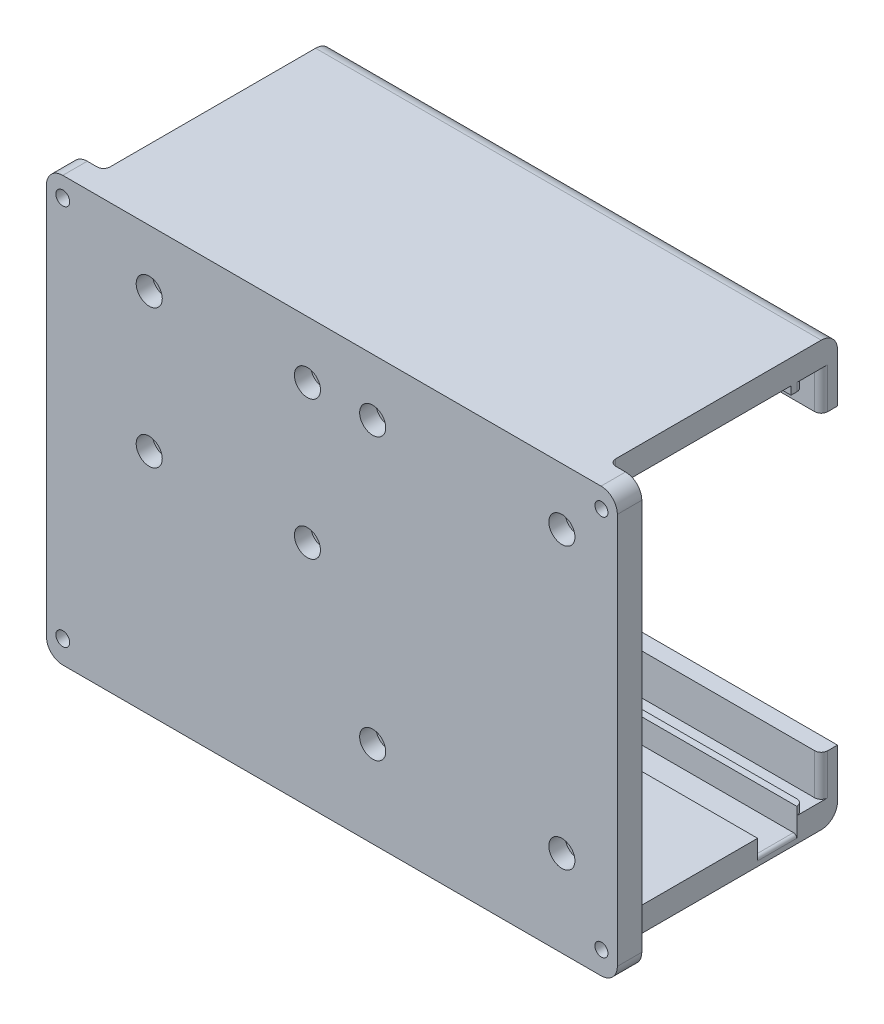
ISO-10303-21;
HEADER;
FILE_DESCRIPTION(('STEP AP214'),'2;1');
FILE_NAME('part.step','',(''),(''),'','','');
FILE_SCHEMA(('AUTOMOTIVE_DESIGN { 1 0 10303 214 1 1 1 1 }'));
ENDSEC;
DATA;
#1=APPLICATION_CONTEXT('core data for automotive mechanical design processes');
#2=APPLICATION_PROTOCOL_DEFINITION('international standard','automotive_design',2000,#1);
#3=PRODUCT_CONTEXT('',#1,'mechanical');
#4=PRODUCT('Part','Part','',(#3));
#5=PRODUCT_RELATED_PRODUCT_CATEGORY('part','',(#4));
#6=PRODUCT_DEFINITION_FORMATION('','',#4);
#7=PRODUCT_DEFINITION_CONTEXT('part definition',#1,'design');
#8=PRODUCT_DEFINITION('design','',#6,#7);
#9=PRODUCT_DEFINITION_SHAPE('','',#8);
#10=(LENGTH_UNIT() NAMED_UNIT(*) SI_UNIT(.MILLI.,.METRE.));
#11=(NAMED_UNIT(*) PLANE_ANGLE_UNIT() SI_UNIT($,.RADIAN.));
#12=(NAMED_UNIT(*) SI_UNIT($,.STERADIAN.) SOLID_ANGLE_UNIT());
#13=UNCERTAINTY_MEASURE_WITH_UNIT(LENGTH_MEASURE(1.E-05),#10,'distance_accuracy_value','');
#14=(GEOMETRIC_REPRESENTATION_CONTEXT(3) GLOBAL_UNCERTAINTY_ASSIGNED_CONTEXT((#13)) GLOBAL_UNIT_ASSIGNED_CONTEXT((#10,
#11,#12)) REPRESENTATION_CONTEXT('',''));
#15=CARTESIAN_POINT('',(0.,0.,0.));
#16=DIRECTION('',(0.,0.,1.));
#17=DIRECTION('',(1.,0.,0.));
#18=AXIS2_PLACEMENT_3D('',#15,#16,#17);
#19=CARTESIAN_POINT('',(70.0000000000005,70.,-0.00100000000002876));
#20=DIRECTION('',(0.,0.,1.));
#21=DIRECTION('',(1.,0.,0.));
#22=AXIS2_PLACEMENT_3D('',#19,#20,#21);
#23=CYLINDRICAL_SURFACE('',#22,1.625);
#24=CARTESIAN_POINT('',(70.0000000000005,70.,70.));
#25=DIRECTION('',(0.,0.,1.));
#26=DIRECTION('',(0.,-1.,0.));
#27=AXIS2_PLACEMENT_3D('',#24,#25,#26);
#28=CIRCLE('',#27,1.625);
#29=CARTESIAN_POINT('',(70.0000000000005,68.375,70.));
#30=VERTEX_POINT('',#29);
#31=EDGE_CURVE('E749',#30,#30,#28,.F.);
#32=ORIENTED_EDGE('',*,*,#31,.T.);
#33=EDGE_LOOP('',(#32));
#34=FACE_BOUND('',#33,.T.);
#35=CARTESIAN_POINT('',(70.0000000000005,70.,72.5));
#36=DIRECTION('',(0.,0.,1.));
#37=DIRECTION('',(1.,0.,0.));
#38=AXIS2_PLACEMENT_3D('',#35,#36,#37);
#39=CIRCLE('',#38,1.625);
#40=CARTESIAN_POINT('',(71.6250000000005,70.,72.5));
#41=VERTEX_POINT('',#40);
#42=EDGE_CURVE('E762',#41,#41,#39,.F.);
#43=ORIENTED_EDGE('',*,*,#42,.F.);
#44=EDGE_LOOP('',(#43));
#45=FACE_BOUND('',#44,.T.);
#46=ADVANCED_FACE('F37',(#34,#45),#23,.F.);
#47=CARTESIAN_POINT('',(21.5,112.5,-0.00100000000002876));
#48=DIRECTION('',(0.,0.,1.));
#49=DIRECTION('',(1.,0.,0.));
#50=AXIS2_PLACEMENT_3D('',#47,#48,#49);
#51=CYLINDRICAL_SURFACE('',#50,1.625);
#52=CARTESIAN_POINT('',(21.5,112.5,70.));
#53=DIRECTION('',(0.,0.,1.));
#54=DIRECTION('',(0.,-1.,0.));
#55=AXIS2_PLACEMENT_3D('',#52,#53,#54);
#56=CIRCLE('',#55,1.625);
#57=CARTESIAN_POINT('',(21.5,110.875,70.));
#58=VERTEX_POINT('',#57);
#59=EDGE_CURVE('E833',#58,#58,#56,.F.);
#60=ORIENTED_EDGE('',*,*,#59,.T.);
#61=EDGE_LOOP('',(#60));
#62=FACE_BOUND('',#61,.T.);
#63=CARTESIAN_POINT('',(21.5,112.5,72.5));
#64=DIRECTION('',(0.,0.,1.));
#65=DIRECTION('',(1.,0.,0.));
#66=AXIS2_PLACEMENT_3D('',#63,#64,#65);
#67=CIRCLE('',#66,1.625);
#68=CARTESIAN_POINT('',(23.125,112.5,72.5));
#69=VERTEX_POINT('',#68);
#70=EDGE_CURVE('E759',#69,#69,#67,.F.);
#71=ORIENTED_EDGE('',*,*,#70,.F.);
#72=EDGE_LOOP('',(#71));
#73=FACE_BOUND('',#72,.T.);
#74=ADVANCED_FACE('F1105',(#62,#73),#51,.F.);
#75=CARTESIAN_POINT('',(21.5000000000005,69.9999999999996,-0.00100000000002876));
#76=DIRECTION('',(0.,0.,1.));
#77=DIRECTION('',(1.,0.,0.));
#78=AXIS2_PLACEMENT_3D('',#75,#76,#77);
#79=CYLINDRICAL_SURFACE('',#78,1.625);
#80=CARTESIAN_POINT('',(21.5000000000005,69.9999999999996,70.));
#81=DIRECTION('',(0.,0.,1.));
#82=DIRECTION('',(0.,-1.,0.));
#83=AXIS2_PLACEMENT_3D('',#80,#81,#82);
#84=CIRCLE('',#83,1.625);
#85=CARTESIAN_POINT('',(21.5000000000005,68.3749999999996,70.));
#86=VERTEX_POINT('',#85);
#87=EDGE_CURVE('E837',#86,#86,#84,.F.);
#88=ORIENTED_EDGE('',*,*,#87,.T.);
#89=EDGE_LOOP('',(#88));
#90=FACE_BOUND('',#89,.T.);
#91=CARTESIAN_POINT('',(21.5000000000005,69.9999999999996,72.5));
#92=DIRECTION('',(0.,0.,1.));
#93=DIRECTION('',(1.,0.,0.));
#94=AXIS2_PLACEMENT_3D('',#91,#92,#93);
#95=CIRCLE('',#94,1.625);
#96=CARTESIAN_POINT('',(23.1250000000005,69.9999999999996,72.5));
#97=VERTEX_POINT('',#96);
#98=EDGE_CURVE('E755',#97,#97,#95,.F.);
#99=ORIENTED_EDGE('',*,*,#98,.F.);
#100=EDGE_LOOP('',(#99));
#101=FACE_BOUND('',#100,.T.);
#102=ADVANCED_FACE('F1111',(#90,#101),#79,.F.);
#103=CARTESIAN_POINT('',(70.,112.5,-0.00100000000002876));
#104=DIRECTION('',(0.,0.,1.));
#105=DIRECTION('',(1.,0.,0.));
#106=AXIS2_PLACEMENT_3D('',#103,#104,#105);
#107=CYLINDRICAL_SURFACE('',#106,1.625);
#108=CARTESIAN_POINT('',(70.,112.5,70.));
#109=DIRECTION('',(0.,0.,1.));
#110=DIRECTION('',(0.,-1.,0.));
#111=AXIS2_PLACEMENT_3D('',#108,#109,#110);
#112=CIRCLE('',#111,1.625);
#113=CARTESIAN_POINT('',(70.,110.875,70.));
#114=VERTEX_POINT('',#113);
#115=EDGE_CURVE('E838',#114,#114,#112,.F.);
#116=ORIENTED_EDGE('',*,*,#115,.T.);
#117=EDGE_LOOP('',(#116));
#118=FACE_BOUND('',#117,.T.);
#119=CARTESIAN_POINT('',(70.,112.5,72.5));
#120=DIRECTION('',(0.,0.,1.));
#121=DIRECTION('',(1.,0.,0.));
#122=AXIS2_PLACEMENT_3D('',#119,#120,#121);
#123=CIRCLE('',#122,1.625);
#124=CARTESIAN_POINT('',(71.625,112.5,72.5));
#125=VERTEX_POINT('',#124);
#126=EDGE_CURVE('E752',#125,#125,#123,.F.);
#127=ORIENTED_EDGE('',*,*,#126,.F.);
#128=EDGE_LOOP('',(#127));
#129=FACE_BOUND('',#128,.T.);
#130=ADVANCED_FACE('F1752',(#118,#129),#107,.F.);
#131=CARTESIAN_POINT('',(5.,0.,0.));
#132=DIRECTION('',(-1.,0.,0.));
#133=DIRECTION('',(0.,0.,1.));
#134=AXIS2_PLACEMENT_3D('',#131,#132,#133);
#135=PLANE('',#134);
#136=DIRECTION('',(0.,-1.,0.));
#137=VECTOR('',#136,1.);
#138=CARTESIAN_POINT('',(5.,33.5,12.5));
#139=LINE('',#138,#137);
#140=CARTESIAN_POINT('',(5.,33.5,12.5));
#141=VERTEX_POINT('',#140);
#142=CARTESIAN_POINT('',(5.,2.5,12.5));
#143=VERTEX_POINT('',#142);
#144=EDGE_CURVE('E877',#141,#143,#139,.T.);
#145=ORIENTED_EDGE('',*,*,#144,.F.);
#146=DIRECTION('',(0.,0.,-1.));
#147=VECTOR('',#146,1.);
#148=CARTESIAN_POINT('',(5.00000000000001,33.5,26.5));
#149=LINE('',#148,#147);
#150=CARTESIAN_POINT('',(5.00000000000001,33.5,24.5));
#151=VERTEX_POINT('',#150);
#152=EDGE_CURVE('E849',#151,#141,#149,.T.);
#153=ORIENTED_EDGE('',*,*,#152,.F.);
#154=DIRECTION('',(0.,-1.,0.));
#155=VECTOR('',#154,1.);
#156=CARTESIAN_POINT('',(5.,33.5,24.5));
#157=LINE('',#156,#155);
#158=CARTESIAN_POINT('',(5.,2.5,24.5));
#159=VERTEX_POINT('',#158);
#160=EDGE_CURVE('E883',#151,#159,#157,.T.);
#161=ORIENTED_EDGE('',*,*,#160,.T.);
#162=DIRECTION('',(0.,0.,-1.));
#163=VECTOR('',#162,1.);
#164=CARTESIAN_POINT('',(5.,2.5,24.5));
#165=LINE('',#164,#163);
#166=EDGE_CURVE('E880',#159,#143,#165,.T.);
#167=ORIENTED_EDGE('',*,*,#166,.T.);
#168=EDGE_LOOP('',(#145,#153,#161,#167));
#169=FACE_BOUND('',#168,.T.);
#170=ADVANCED_FACE('F1171',(#169),#135,.F.);
#171=CARTESIAN_POINT('',(0.,0.,10.5));
#172=DIRECTION('',(0.,0.,1.));
#173=DIRECTION('',(0.,-1.,0.));
#174=AXIS2_PLACEMENT_3D('',#171,#172,#173);
#175=PLANE('',#174);
#176=DIRECTION('',(-1.,0.,0.));
#177=VECTOR('',#176,1.);
#178=CARTESIAN_POINT('',(165.,9.99999999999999,10.5));
#179=LINE('',#178,#177);
#180=CARTESIAN_POINT('',(153.,9.99999999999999,10.5));
#181=VERTEX_POINT('',#180);
#182=CARTESIAN_POINT('',(105.,9.99999999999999,10.5));
#183=VERTEX_POINT('',#182);
#184=EDGE_CURVE('E477',#181,#183,#179,.T.);
#185=ORIENTED_EDGE('',*,*,#184,.F.);
#186=DIRECTION('',(0.,1.,0.));
#187=VECTOR('',#186,1.);
#188=CARTESIAN_POINT('',(153.,0.,10.5));
#189=LINE('',#188,#187);
#190=CARTESIAN_POINT('',(153.,7.50000000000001,10.5));
#191=VERTEX_POINT('',#190);
#192=EDGE_CURVE('E640',#181,#191,#189,.F.);
#193=ORIENTED_EDGE('',*,*,#192,.T.);
#194=DIRECTION('',(-1.,0.,0.));
#195=VECTOR('',#194,1.);
#196=CARTESIAN_POINT('',(165.,7.50000000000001,10.5));
#197=LINE('',#196,#195);
#198=CARTESIAN_POINT('',(5.,7.50000000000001,10.5));
#199=VERTEX_POINT('',#198);
#200=EDGE_CURVE('E556',#191,#199,#197,.T.);
#201=ORIENTED_EDGE('',*,*,#200,.T.);
#202=DIRECTION('',(0.,-1.,0.));
#203=VECTOR('',#202,1.);
#204=CARTESIAN_POINT('',(5.,0.,10.5));
#205=LINE('',#204,#203);
#206=CARTESIAN_POINT('',(5.,36.5,10.5));
#207=VERTEX_POINT('',#206);
#208=EDGE_CURVE('E460',#207,#199,#205,.T.);
#209=ORIENTED_EDGE('',*,*,#208,.F.);
#210=DIRECTION('',(1.,0.,0.));
#211=VECTOR('',#210,1.);
#212=CARTESIAN_POINT('',(5.,36.5,10.5));
#213=LINE('',#212,#211);
#214=CARTESIAN_POINT('',(6.50000000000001,36.5,10.5));
#215=VERTEX_POINT('',#214);
#216=EDGE_CURVE('E425',#207,#215,#213,.T.);
#217=ORIENTED_EDGE('',*,*,#216,.T.);
#218=DIRECTION('',(0.,-1.,0.));
#219=VECTOR('',#218,1.);
#220=CARTESIAN_POINT('',(6.50000000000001,33.5,10.5));
#221=LINE('',#220,#219);
#222=CARTESIAN_POINT('',(6.50000000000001,35.5,10.5));
#223=VERTEX_POINT('',#222);
#224=EDGE_CURVE('E440',#215,#223,#221,.T.);
#225=ORIENTED_EDGE('',*,*,#224,.T.);
#226=CARTESIAN_POINT('',(8.50000000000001,35.5,10.5));
#227=DIRECTION('',(0.,0.,1.));
#228=DIRECTION('',(0.,-1.,0.));
#229=AXIS2_PLACEMENT_3D('',#226,#227,#228);
#230=CIRCLE('',#229,2.);
#231=CARTESIAN_POINT('',(8.50000000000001,33.5,10.5));
#232=VERTEX_POINT('',#231);
#233=EDGE_CURVE('E613',#223,#232,#230,.T.);
#234=ORIENTED_EDGE('',*,*,#233,.T.);
#235=DIRECTION('',(-1.,0.,0.));
#236=VECTOR('',#235,1.);
#237=CARTESIAN_POINT('',(94.,33.5,10.5));
#238=LINE('',#237,#236);
#239=CARTESIAN_POINT('',(92.,33.5,10.5));
#240=VERTEX_POINT('',#239);
#241=EDGE_CURVE('E863',#240,#232,#238,.T.);
#242=ORIENTED_EDGE('',*,*,#241,.F.);
#243=CARTESIAN_POINT('',(92.,35.5,10.5));
#244=DIRECTION('',(0.,0.,1.));
#245=DIRECTION('',(0.,-1.,0.));
#246=AXIS2_PLACEMENT_3D('',#243,#244,#245);
#247=CIRCLE('',#246,2.);
#248=CARTESIAN_POINT('',(94.,35.5,10.5));
#249=VERTEX_POINT('',#248);
#250=EDGE_CURVE('E607',#240,#249,#247,.T.);
#251=ORIENTED_EDGE('',*,*,#250,.T.);
#252=DIRECTION('',(-1.,0.,0.));
#253=VECTOR('',#252,1.);
#254=CARTESIAN_POINT('',(105.,35.5,10.5));
#255=LINE('',#254,#253);
#256=CARTESIAN_POINT('',(105.,35.5,10.5));
#257=VERTEX_POINT('',#256);
#258=EDGE_CURVE('E909',#257,#249,#255,.T.);
#259=ORIENTED_EDGE('',*,*,#258,.F.);
#260=DIRECTION('',(0.,-1.,0.));
#261=VECTOR('',#260,1.);
#262=CARTESIAN_POINT('',(105.,35.5,10.5));
#263=LINE('',#262,#261);
#264=EDGE_CURVE('E919',#257,#183,#263,.T.);
#265=ORIENTED_EDGE('',*,*,#264,.T.);
#266=EDGE_LOOP('',(#185,#193,#201,#209,#217,#225,#234,#242,#251,#259,#265));
#267=FACE_BOUND('',#266,.T.);
#268=ADVANCED_FACE('F1074',(#267),#175,.F.);
#269=CARTESIAN_POINT('',(0.,0.,26.5));
#270=DIRECTION('',(0.,0.,-1.));
#271=DIRECTION('',(0.,1.,0.));
#272=AXIS2_PLACEMENT_3D('',#269,#270,#271);
#273=PLANE('',#272);
#274=DIRECTION('',(0.,1.,0.));
#275=VECTOR('',#274,1.);
#276=CARTESIAN_POINT('',(0.,0.,26.5));
#277=LINE('',#276,#275);
#278=CARTESIAN_POINT('',(0.,12.5,26.5));
#279=VERTEX_POINT('',#278);
#280=CARTESIAN_POINT('',(0.,122.5,26.5));
#281=VERTEX_POINT('',#280);
#282=EDGE_CURVE('E447',#279,#281,#277,.T.);
#283=ORIENTED_EDGE('',*,*,#282,.F.);
#284=DIRECTION('',(1.,0.,0.));
#285=VECTOR('',#284,1.);
#286=CARTESIAN_POINT('',(105.,12.5,26.5));
#287=LINE('',#286,#285);
#288=CARTESIAN_POINT('',(105.,12.5,26.5));
#289=VERTEX_POINT('',#288);
#290=EDGE_CURVE('E570',#279,#289,#287,.T.);
#291=ORIENTED_EDGE('',*,*,#290,.T.);
#292=DIRECTION('',(0.,-1.,0.));
#293=VECTOR('',#292,1.);
#294=CARTESIAN_POINT('',(105.,35.5,26.5));
#295=LINE('',#294,#293);
#296=CARTESIAN_POINT('',(105.,35.5,26.5));
#297=VERTEX_POINT('',#296);
#298=EDGE_CURVE('E914',#297,#289,#295,.T.);
#299=ORIENTED_EDGE('',*,*,#298,.F.);
#300=DIRECTION('',(1.,0.,0.));
#301=VECTOR('',#300,1.);
#302=CARTESIAN_POINT('',(105.,35.5,26.5));
#303=LINE('',#302,#301);
#304=CARTESIAN_POINT('',(94.,35.5,26.5));
#305=VERTEX_POINT('',#304);
#306=EDGE_CURVE('E912',#305,#297,#303,.T.);
#307=ORIENTED_EDGE('',*,*,#306,.F.);
#308=CARTESIAN_POINT('',(92.,35.5,26.5));
#309=DIRECTION('',(0.,0.,-1.));
#310=DIRECTION('',(0.,1.,0.));
#311=AXIS2_PLACEMENT_3D('',#308,#309,#310);
#312=CIRCLE('',#311,2.);
#313=CARTESIAN_POINT('',(92.,33.5,26.5));
#314=VERTEX_POINT('',#313);
#315=EDGE_CURVE('E609',#305,#314,#312,.T.);
#316=ORIENTED_EDGE('',*,*,#315,.T.);
#317=DIRECTION('',(-1.,0.,0.));
#318=VECTOR('',#317,1.);
#319=CARTESIAN_POINT('',(94.,33.5,26.5));
#320=LINE('',#319,#318);
#321=CARTESIAN_POINT('',(8.50000000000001,33.5,26.5));
#322=VERTEX_POINT('',#321);
#323=EDGE_CURVE('E859',#314,#322,#320,.T.);
#324=ORIENTED_EDGE('',*,*,#323,.T.);
#325=CARTESIAN_POINT('',(8.50000000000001,35.5,26.5));
#326=DIRECTION('',(0.,0.,-1.));
#327=DIRECTION('',(0.,1.,0.));
#328=AXIS2_PLACEMENT_3D('',#325,#326,#327);
#329=CIRCLE('',#328,2.);
#330=CARTESIAN_POINT('',(6.50000000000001,35.5,26.5));
#331=VERTEX_POINT('',#330);
#332=EDGE_CURVE('E619',#322,#331,#329,.T.);
#333=ORIENTED_EDGE('',*,*,#332,.T.);
#334=DIRECTION('',(0.,-1.,0.));
#335=VECTOR('',#334,1.);
#336=CARTESIAN_POINT('',(6.50000000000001,33.5,26.5));
#337=LINE('',#336,#335);
#338=CARTESIAN_POINT('',(6.50000000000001,36.5,26.5));
#339=VERTEX_POINT('',#338);
#340=EDGE_CURVE('E430',#339,#331,#337,.T.);
#341=ORIENTED_EDGE('',*,*,#340,.F.);
#342=DIRECTION('',(1.,0.,0.));
#343=VECTOR('',#342,1.);
#344=CARTESIAN_POINT('',(5.00000000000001,36.5,26.5));
#345=LINE('',#344,#343);
#346=CARTESIAN_POINT('',(5.00000000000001,36.5,26.5));
#347=VERTEX_POINT('',#346);
#348=EDGE_CURVE('E423',#347,#339,#345,.T.);
#349=ORIENTED_EDGE('',*,*,#348,.F.);
#350=DIRECTION('',(0.,1.,0.));
#351=VECTOR('',#350,1.);
#352=CARTESIAN_POINT('',(5.,0.,26.5));
#353=LINE('',#352,#351);
#354=CARTESIAN_POINT('',(5.,122.5,26.5));
#355=VERTEX_POINT('',#354);
#356=EDGE_CURVE('E437',#347,#355,#353,.T.);
#357=ORIENTED_EDGE('',*,*,#356,.T.);
#358=DIRECTION('',(-1.,0.,0.));
#359=VECTOR('',#358,1.);
#360=CARTESIAN_POINT('',(0.,122.5,26.5));
#361=LINE('',#360,#359);
#362=EDGE_CURVE('E451',#355,#281,#361,.T.);
#363=ORIENTED_EDGE('',*,*,#362,.T.);
#364=EDGE_LOOP('',(#283,#291,#299,#307,#316,#324,#333,#341,#349,#357,#363));
#365=FACE_BOUND('',#364,.T.);
#366=ADVANCED_FACE('F435',(#365),#273,.F.);
#367=CARTESIAN_POINT('',(0.,35.5,0.));
#368=DIRECTION('',(0.,1.,0.));
#369=DIRECTION('',(0.,0.,1.));
#370=AXIS2_PLACEMENT_3D('',#367,#368,#369);
#371=PLANE('',#370);
#372=ORIENTED_EDGE('',*,*,#258,.T.);
#373=DIRECTION('',(0.,0.,1.));
#374=VECTOR('',#373,1.);
#375=CARTESIAN_POINT('',(94.,35.5,10.5));
#376=LINE('',#375,#374);
#377=CARTESIAN_POINT('',(94.,35.5,12.5));
#378=VERTEX_POINT('',#377);
#379=EDGE_CURVE('E860',#249,#378,#376,.T.);
#380=ORIENTED_EDGE('',*,*,#379,.T.);
#381=CARTESIAN_POINT('',(94.,35.5,24.5));
#382=VERTEX_POINT('',#381);
#383=EDGE_CURVE('E869',#378,#382,#376,.T.);
#384=ORIENTED_EDGE('',*,*,#383,.T.);
#385=EDGE_CURVE('E851',#382,#305,#376,.T.);
#386=ORIENTED_EDGE('',*,*,#385,.T.);
#387=ORIENTED_EDGE('',*,*,#306,.T.);
#388=DIRECTION('',(0.,0.,-1.));
#389=VECTOR('',#388,1.);
#390=CARTESIAN_POINT('',(105.,35.5,26.5));
#391=LINE('',#390,#389);
#392=EDGE_CURVE('E906',#297,#257,#391,.T.);
#393=ORIENTED_EDGE('',*,*,#392,.T.);
#394=EDGE_LOOP('',(#372,#380,#384,#386,#387,#393));
#395=FACE_BOUND('',#394,.T.);
#396=ADVANCED_FACE('F1080',(#395),#371,.T.);
#397=CARTESIAN_POINT('',(205.,33.5,24.5));
#398=DIRECTION('',(0.,1.,0.));
#399=DIRECTION('',(0.,0.,1.));
#400=AXIS2_PLACEMENT_3D('',#397,#398,#399);
#401=PLANE('',#400);
#402=DIRECTION('',(-1.,0.,0.));
#403=VECTOR('',#402,1.);
#404=CARTESIAN_POINT('',(205.,33.5,12.5));
#405=LINE('',#404,#403);
#406=CARTESIAN_POINT('',(104.,33.5,12.5));
#407=VERTEX_POINT('',#406);
#408=CARTESIAN_POINT('',(94.,33.5,12.5));
#409=VERTEX_POINT('',#408);
#410=EDGE_CURVE('E886',#407,#409,#405,.T.);
#411=ORIENTED_EDGE('',*,*,#410,.F.);
#412=DIRECTION('',(0.,0.,-1.));
#413=VECTOR('',#412,1.);
#414=CARTESIAN_POINT('',(104.,33.5,24.5));
#415=LINE('',#414,#413);
#416=CARTESIAN_POINT('',(104.,33.5,24.5));
#417=VERTEX_POINT('',#416);
#418=EDGE_CURVE('E730',#407,#417,#415,.F.);
#419=ORIENTED_EDGE('',*,*,#418,.T.);
#420=DIRECTION('',(-1.,0.,0.));
#421=VECTOR('',#420,1.);
#422=CARTESIAN_POINT('',(205.,33.5,24.5));
#423=LINE('',#422,#421);
#424=CARTESIAN_POINT('',(94.,33.5,24.5));
#425=VERTEX_POINT('',#424);
#426=EDGE_CURVE('E887',#417,#425,#423,.T.);
#427=ORIENTED_EDGE('',*,*,#426,.T.);
#428=DIRECTION('',(0.,0.,1.));
#429=VECTOR('',#428,1.);
#430=CARTESIAN_POINT('',(94.,33.5,10.5));
#431=LINE('',#430,#429);
#432=EDGE_CURVE('E856',#409,#425,#431,.T.);
#433=ORIENTED_EDGE('',*,*,#432,.F.);
#434=EDGE_LOOP('',(#411,#419,#427,#433));
#435=FACE_BOUND('',#434,.T.);
#436=ADVANCED_FACE('F1145',(#435),#401,.F.);
#437=CARTESIAN_POINT('',(165.,7.50000000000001,0.));
#438=DIRECTION('',(0.,-1.,0.));
#439=DIRECTION('',(0.,0.,-1.));
#440=AXIS2_PLACEMENT_3D('',#437,#438,#439);
#441=PLANE('',#440);
#442=DIRECTION('',(0.,0.,-1.));
#443=VECTOR('',#442,1.);
#444=CARTESIAN_POINT('',(105.,7.50000000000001,26.5));
#445=LINE('',#444,#443);
#446=CARTESIAN_POINT('',(105.,7.50000000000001,31.5));
#447=VERTEX_POINT('',#446);
#448=CARTESIAN_POINT('',(105.,7.50000000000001,25.5));
#449=VERTEX_POINT('',#448);
#450=EDGE_CURVE('E905',#447,#449,#445,.T.);
#451=ORIENTED_EDGE('',*,*,#450,.F.);
#452=DIRECTION('',(1.,0.,0.));
#453=VECTOR('',#452,1.);
#454=CARTESIAN_POINT('',(0.,7.50000000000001,31.5));
#455=LINE('',#454,#453);
#456=CARTESIAN_POINT('',(0.,7.50000000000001,31.5));
#457=VERTEX_POINT('',#456);
#458=EDGE_CURVE('E573',#447,#457,#455,.F.);
#459=ORIENTED_EDGE('',*,*,#458,.T.);
#460=DIRECTION('',(0.,0.,1.));
#461=VECTOR('',#460,1.);
#462=CARTESIAN_POINT('',(0.,7.50000000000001,0.));
#463=LINE('',#462,#461);
#464=CARTESIAN_POINT('',(0.,7.50000000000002,68.));
#465=VERTEX_POINT('',#464);
#466=EDGE_CURVE('E508',#457,#465,#463,.T.);
#467=ORIENTED_EDGE('',*,*,#466,.T.);
#468=CARTESIAN_POINT('',(-2.,7.50000000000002,68.));
#469=DIRECTION('',(0.,-1.,0.));
#470=DIRECTION('',(0.,0.,-1.));
#471=AXIS2_PLACEMENT_3D('',#468,#469,#470);
#472=CIRCLE('',#471,2.);
#473=CARTESIAN_POINT('',(-2.,7.50000000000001,70.));
#474=VERTEX_POINT('',#473);
#475=EDGE_CURVE('E679',#465,#474,#472,.T.);
#476=ORIENTED_EDGE('',*,*,#475,.T.);
#477=DIRECTION('',(-1.,0.,0.));
#478=VECTOR('',#477,1.);
#479=CARTESIAN_POINT('',(165.,7.50000000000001,70.));
#480=LINE('',#479,#478);
#481=CARTESIAN_POINT('',(157.,7.50000000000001,70.));
#482=VERTEX_POINT('',#481);
#483=EDGE_CURVE('E514',#482,#474,#480,.T.);
#484=ORIENTED_EDGE('',*,*,#483,.F.);
#485=CARTESIAN_POINT('',(157.,7.50000000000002,68.));
#486=DIRECTION('',(0.,-1.,0.));
#487=DIRECTION('',(0.,0.,-1.));
#488=AXIS2_PLACEMENT_3D('',#485,#486,#487);
#489=CIRCLE('',#488,2.);
#490=CARTESIAN_POINT('',(155.,7.50000000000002,68.));
#491=VERTEX_POINT('',#490);
#492=EDGE_CURVE('E692',#482,#491,#489,.T.);
#493=ORIENTED_EDGE('',*,*,#492,.T.);
#494=DIRECTION('',(0.,0.,1.));
#495=VECTOR('',#494,1.);
#496=CARTESIAN_POINT('',(155.,7.50000000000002,75.));
#497=LINE('',#496,#495);
#498=CARTESIAN_POINT('',(155.,7.50000000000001,24.5));
#499=VERTEX_POINT('',#498);
#500=EDGE_CURVE('E517',#499,#491,#497,.T.);
#501=ORIENTED_EDGE('',*,*,#500,.F.);
#502=DIRECTION('',(1.,0.,0.));
#503=VECTOR('',#502,1.);
#504=CARTESIAN_POINT('',(165.,7.50000000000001,24.5));
#505=LINE('',#504,#503);
#506=CARTESIAN_POINT('',(104.,7.50000000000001,24.5));
#507=VERTEX_POINT('',#506);
#508=EDGE_CURVE('E901',#507,#499,#505,.T.);
#509=ORIENTED_EDGE('',*,*,#508,.F.);
#510=CARTESIAN_POINT('',(104.,7.50000000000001,25.5));
#511=DIRECTION('',(0.,-1.,0.));
#512=DIRECTION('',(0.,0.,-1.));
#513=AXIS2_PLACEMENT_3D('',#510,#511,#512);
#514=CIRCLE('',#513,1.);
#515=EDGE_CURVE('E739',#507,#449,#514,.T.);
#516=ORIENTED_EDGE('',*,*,#515,.T.);
#517=EDGE_LOOP('',(#451,#459,#467,#476,#484,#493,#501,#509,#516));
#518=FACE_BOUND('',#517,.T.);
#519=ADVANCED_FACE('F1028',(#518),#441,.F.);
#520=CARTESIAN_POINT('',(155.,0.,75.));
#521=DIRECTION('',(-1.,0.,0.));
#522=DIRECTION('',(0.,0.,1.));
#523=AXIS2_PLACEMENT_3D('',#520,#521,#522);
#524=PLANE('',#523);
#525=DIRECTION('',(0.,-1.,0.));
#526=VECTOR('',#525,1.);
#527=CARTESIAN_POINT('',(155.,0.,12.5));
#528=LINE('',#527,#526);
#529=CARTESIAN_POINT('',(155.,7.50000000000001,12.5));
#530=VERTEX_POINT('',#529);
#531=CARTESIAN_POINT('',(155.,1.5,12.5));
#532=VERTEX_POINT('',#531);
#533=EDGE_CURVE('E897',#530,#532,#528,.T.);
#534=ORIENTED_EDGE('',*,*,#533,.T.);
#535=DIRECTION('',(0.,0.,-1.));
#536=VECTOR('',#535,1.);
#537=CARTESIAN_POINT('',(155.,1.5,24.5));
#538=LINE('',#537,#536);
#539=CARTESIAN_POINT('',(155.,1.5,24.5));
#540=VERTEX_POINT('',#539);
#541=EDGE_CURVE('E718',#532,#540,#538,.F.);
#542=ORIENTED_EDGE('',*,*,#541,.T.);
#543=DIRECTION('',(0.,-1.,0.));
#544=VECTOR('',#543,1.);
#545=CARTESIAN_POINT('',(155.,0.,24.5));
#546=LINE('',#545,#544);
#547=EDGE_CURVE('E903',#499,#540,#546,.T.);
#548=ORIENTED_EDGE('',*,*,#547,.F.);
#549=ORIENTED_EDGE('',*,*,#500,.T.);
#550=DIRECTION('',(0.,1.,0.));
#551=VECTOR('',#550,1.);
#552=CARTESIAN_POINT('',(155.,0.,68.));
#553=LINE('',#552,#551);
#554=CARTESIAN_POINT('',(155.,0.,68.));
#555=VERTEX_POINT('',#554);
#556=EDGE_CURVE('E675',#491,#555,#553,.F.);
#557=ORIENTED_EDGE('',*,*,#556,.T.);
#558=DIRECTION('',(0.,0.,-1.));
#559=VECTOR('',#558,1.);
#560=CARTESIAN_POINT('',(155.,0.,75.));
#561=LINE('',#560,#559);
#562=CARTESIAN_POINT('',(155.,0.,5.));
#563=VERTEX_POINT('',#562);
#564=EDGE_CURVE('E550',#555,#563,#561,.T.);
#565=ORIENTED_EDGE('',*,*,#564,.T.);
#566=CARTESIAN_POINT('',(155.,5.,5.));
#567=DIRECTION('',(-1.,0.,0.));
#568=DIRECTION('',(0.,0.,1.));
#569=AXIS2_PLACEMENT_3D('',#566,#567,#568);
#570=CIRCLE('',#569,5.);
#571=CARTESIAN_POINT('',(155.,5.,0.));
#572=VERTEX_POINT('',#571);
#573=EDGE_CURVE('E700',#563,#572,#570,.F.);
#574=ORIENTED_EDGE('',*,*,#573,.T.);
#575=DIRECTION('',(0.,1.,0.));
#576=VECTOR('',#575,1.);
#577=CARTESIAN_POINT('',(155.,0.,0.));
#578=LINE('',#577,#576);
#579=CARTESIAN_POINT('',(155.,20.,0.));
#580=VERTEX_POINT('',#579);
#581=EDGE_CURVE('E542',#572,#580,#578,.T.);
#582=ORIENTED_EDGE('',*,*,#581,.T.);
#583=DIRECTION('',(0.,0.,1.));
#584=VECTOR('',#583,1.);
#585=CARTESIAN_POINT('',(155.,20.,75.));
#586=LINE('',#585,#584);
#587=CARTESIAN_POINT('',(155.,20.,2.99999999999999));
#588=VERTEX_POINT('',#587);
#589=EDGE_CURVE('E481',#580,#588,#586,.T.);
#590=ORIENTED_EDGE('',*,*,#589,.T.);
#591=DIRECTION('',(0.,1.,0.));
#592=VECTOR('',#591,1.);
#593=CARTESIAN_POINT('',(155.,0.,2.99999999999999));
#594=LINE('',#593,#592);
#595=CARTESIAN_POINT('',(155.,7.50000000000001,2.99999999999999));
#596=VERTEX_POINT('',#595);
#597=EDGE_CURVE('E635',#588,#596,#594,.F.);
#598=ORIENTED_EDGE('',*,*,#597,.T.);
#599=EDGE_CURVE('E519',#596,#530,#497,.T.);
#600=ORIENTED_EDGE('',*,*,#599,.T.);
#601=EDGE_LOOP('',(#534,#542,#548,#549,#557,#565,#574,#582,#590,#598,#600));
#602=FACE_BOUND('',#601,.T.);
#603=ADVANCED_FACE('F1039',(#602),#524,.F.);
#604=CARTESIAN_POINT('',(105.,35.5,26.5));
#605=DIRECTION('',(-1.,0.,0.));
#606=DIRECTION('',(0.,0.,1.));
#607=AXIS2_PLACEMENT_3D('',#604,#605,#606);
#608=PLANE('',#607);
#609=ORIENTED_EDGE('',*,*,#450,.T.);
#610=DIRECTION('',(0.,-1.,0.));
#611=VECTOR('',#610,1.);
#612=CARTESIAN_POINT('',(105.,33.5,25.5));
#613=LINE('',#612,#611);
#614=CARTESIAN_POINT('',(105.,34.5,25.5));
#615=VERTEX_POINT('',#614);
#616=EDGE_CURVE('E728',#449,#615,#613,.F.);
#617=ORIENTED_EDGE('',*,*,#616,.T.);
#618=DIRECTION('',(0.,0.,-1.));
#619=VECTOR('',#618,1.);
#620=CARTESIAN_POINT('',(105.,34.5,26.5));
#621=LINE('',#620,#619);
#622=CARTESIAN_POINT('',(105.,34.5,11.5));
#623=VERTEX_POINT('',#622);
#624=EDGE_CURVE('E726',#615,#623,#621,.T.);
#625=ORIENTED_EDGE('',*,*,#624,.T.);
#626=DIRECTION('',(0.,-1.,0.));
#627=VECTOR('',#626,1.);
#628=CARTESIAN_POINT('',(105.,35.5,11.5));
#629=LINE('',#628,#627);
#630=CARTESIAN_POINT('',(105.,9.99999999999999,11.5));
#631=VERTEX_POINT('',#630);
#632=EDGE_CURVE('E724',#623,#631,#629,.T.);
#633=ORIENTED_EDGE('',*,*,#632,.T.);
#634=DIRECTION('',(0.,0.,-1.));
#635=VECTOR('',#634,1.);
#636=CARTESIAN_POINT('',(105.,9.99999999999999,10.5));
#637=LINE('',#636,#635);
#638=EDGE_CURVE('E568',#631,#183,#637,.T.);
#639=ORIENTED_EDGE('',*,*,#638,.T.);
#640=ORIENTED_EDGE('',*,*,#264,.F.);
#641=ORIENTED_EDGE('',*,*,#392,.F.);
#642=ORIENTED_EDGE('',*,*,#298,.T.);
#643=CARTESIAN_POINT('',(105.,12.5,31.5));
#644=DIRECTION('',(-1.,0.,0.));
#645=DIRECTION('',(0.,0.,1.));
#646=AXIS2_PLACEMENT_3D('',#643,#644,#645);
#647=CIRCLE('',#646,5.);
#648=EDGE_CURVE('E575',#289,#447,#647,.T.);
#649=ORIENTED_EDGE('',*,*,#648,.T.);
#650=EDGE_LOOP('',(#609,#617,#625,#633,#639,#640,#641,#642,#649));
#651=FACE_BOUND('',#650,.T.);
#652=ADVANCED_FACE('F1062',(#651),#608,.F.);
#653=CARTESIAN_POINT('',(165.,9.99999999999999,10.5));
#654=DIRECTION('',(0.,-1.,0.));
#655=DIRECTION('',(0.,0.,-1.));
#656=AXIS2_PLACEMENT_3D('',#653,#654,#655);
#657=PLANE('',#656);
#658=DIRECTION('',(1.,0.,0.));
#659=VECTOR('',#658,1.);
#660=CARTESIAN_POINT('',(165.,9.99999999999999,12.5));
#661=LINE('',#660,#659);
#662=CARTESIAN_POINT('',(104.,9.99999999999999,12.5));
#663=VERTEX_POINT('',#662);
#664=CARTESIAN_POINT('',(155.,9.99999999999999,12.5));
#665=VERTEX_POINT('',#664);
#666=EDGE_CURVE('E889',#663,#665,#661,.T.);
#667=ORIENTED_EDGE('',*,*,#666,.T.);
#668=CARTESIAN_POINT('',(153.,9.99999999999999,12.5));
#669=DIRECTION('',(0.,-1.,0.));
#670=DIRECTION('',(0.,0.,-1.));
#671=AXIS2_PLACEMENT_3D('',#668,#669,#670);
#672=CIRCLE('',#671,2.);
#673=EDGE_CURVE('E638',#665,#181,#672,.F.);
#674=ORIENTED_EDGE('',*,*,#673,.T.);
#675=ORIENTED_EDGE('',*,*,#184,.T.);
#676=ORIENTED_EDGE('',*,*,#638,.F.);
#677=CARTESIAN_POINT('',(104.,9.99999999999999,11.5));
#678=DIRECTION('',(0.,-1.,0.));
#679=DIRECTION('',(0.,0.,-1.));
#680=AXIS2_PLACEMENT_3D('',#677,#678,#679);
#681=CIRCLE('',#680,1.);
#682=EDGE_CURVE('E741',#631,#663,#681,.T.);
#683=ORIENTED_EDGE('',*,*,#682,.T.);
#684=EDGE_LOOP('',(#667,#674,#675,#676,#683));
#685=FACE_BOUND('',#684,.T.);
#686=ADVANCED_FACE('F1069',(#685),#657,.F.);
#687=ORIENTED_EDGE('',*,*,#356,.F.);
#688=DIRECTION('',(0.,0.,-1.));
#689=VECTOR('',#688,1.);
#690=CARTESIAN_POINT('',(5.00000000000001,36.5,26.5));
#691=LINE('',#690,#689);
#692=EDGE_CURVE('E420',#347,#207,#691,.T.);
#693=ORIENTED_EDGE('',*,*,#692,.T.);
#694=ORIENTED_EDGE('',*,*,#208,.T.);
#695=DIRECTION('',(0.,0.,-1.));
#696=VECTOR('',#695,1.);
#697=CARTESIAN_POINT('',(5.,7.50000000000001,0.));
#698=LINE('',#697,#696);
#699=CARTESIAN_POINT('',(5.,7.50000000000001,4.99999999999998));
#700=VERTEX_POINT('',#699);
#701=EDGE_CURVE('E462',#199,#700,#698,.T.);
#702=ORIENTED_EDGE('',*,*,#701,.T.);
#703=DIRECTION('',(0.,1.,0.));
#704=VECTOR('',#703,1.);
#705=CARTESIAN_POINT('',(5.,0.,4.99999999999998));
#706=LINE('',#705,#704);
#707=CARTESIAN_POINT('',(5.,20.,4.99999999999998));
#708=VERTEX_POINT('',#707);
#709=EDGE_CURVE('E465',#700,#708,#706,.T.);
#710=ORIENTED_EDGE('',*,*,#709,.T.);
#711=DIRECTION('',(0.,0.,-1.));
#712=VECTOR('',#711,1.);
#713=CARTESIAN_POINT('',(5.,20.,0.));
#714=LINE('',#713,#712);
#715=CARTESIAN_POINT('',(5.,20.,0.));
#716=VERTEX_POINT('',#715);
#717=EDGE_CURVE('E468',#708,#716,#714,.T.);
#718=ORIENTED_EDGE('',*,*,#717,.T.);
#719=DIRECTION('',(0.,1.,0.));
#720=VECTOR('',#719,1.);
#721=CARTESIAN_POINT('',(5.,0.,0.));
#722=LINE('',#721,#720);
#723=CARTESIAN_POINT('',(5.,110.,0.));
#724=VERTEX_POINT('',#723);
#725=EDGE_CURVE('E446',#716,#724,#722,.T.);
#726=ORIENTED_EDGE('',*,*,#725,.T.);
#727=DIRECTION('',(0.,0.,-1.));
#728=VECTOR('',#727,1.);
#729=CARTESIAN_POINT('',(5.,110.,0.));
#730=LINE('',#729,#728);
#731=CARTESIAN_POINT('',(5.,110.,4.99999999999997));
#732=VERTEX_POINT('',#731);
#733=EDGE_CURVE('E471',#732,#724,#730,.T.);
#734=ORIENTED_EDGE('',*,*,#733,.F.);
#735=DIRECTION('',(0.,1.,0.));
#736=VECTOR('',#735,1.);
#737=CARTESIAN_POINT('',(5.,0.,4.99999999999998));
#738=LINE('',#737,#736);
#739=CARTESIAN_POINT('',(5.,122.5,4.99999999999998));
#740=VERTEX_POINT('',#739);
#741=EDGE_CURVE('E474',#732,#740,#738,.T.);
#742=ORIENTED_EDGE('',*,*,#741,.T.);
#743=DIRECTION('',(0.,0.,1.));
#744=VECTOR('',#743,1.);
#745=CARTESIAN_POINT('',(5.,122.5,0.));
#746=LINE('',#745,#744);
#747=CARTESIAN_POINT('',(5.,122.5,10.5));
#748=VERTEX_POINT('',#747);
#749=EDGE_CURVE('E934',#740,#748,#746,.T.);
#750=ORIENTED_EDGE('',*,*,#749,.T.);
#751=DIRECTION('',(0.,-1.,0.));
#752=VECTOR('',#751,1.);
#753=CARTESIAN_POINT('',(5.,0.,10.5));
#754=LINE('',#753,#752);
#755=CARTESIAN_POINT('',(5.,120.,10.5));
#756=VERTEX_POINT('',#755);
#757=EDGE_CURVE('E457',#748,#756,#754,.T.);
#758=ORIENTED_EDGE('',*,*,#757,.T.);
#759=DIRECTION('',(0.,0.,-1.));
#760=VECTOR('',#759,1.);
#761=CARTESIAN_POINT('',(5.,120.,10.5));
#762=LINE('',#761,#760);
#763=CARTESIAN_POINT('',(5.,120.,14.25));
#764=VERTEX_POINT('',#763);
#765=EDGE_CURVE('E565',#764,#756,#762,.T.);
#766=ORIENTED_EDGE('',*,*,#765,.F.);
#767=DIRECTION('',(0.,-1.,0.));
#768=VECTOR('',#767,1.);
#769=CARTESIAN_POINT('',(5.,0.,14.25));
#770=LINE('',#769,#768);
#771=CARTESIAN_POINT('',(5.,122.5,14.25));
#772=VERTEX_POINT('',#771);
#773=EDGE_CURVE('E449',#772,#764,#770,.T.);
#774=ORIENTED_EDGE('',*,*,#773,.F.);
#775=EDGE_CURVE('E444',#772,#355,#746,.T.);
#776=ORIENTED_EDGE('',*,*,#775,.T.);
#777=EDGE_LOOP('',(#687,#693,#694,#702,#710,#718,#726,#734,#742,#750,#758,#766,#774,#776));
#778=FACE_BOUND('',#777,.T.);
#779=ADVANCED_FACE('F442',(#778),#135,.F.);
#780=DIRECTION('',(1.,0.,0.));
#781=VECTOR('',#780,1.);
#782=CARTESIAN_POINT('',(0.,122.5,10.5));
#783=LINE('',#782,#781);
#784=CARTESIAN_POINT('',(153.,122.5,10.5));
#785=VERTEX_POINT('',#784);
#786=EDGE_CURVE('E500',#748,#785,#783,.T.);
#787=ORIENTED_EDGE('',*,*,#786,.T.);
#788=DIRECTION('',(0.,1.,0.));
#789=VECTOR('',#788,1.);
#790=CARTESIAN_POINT('',(153.,0.,10.5));
#791=LINE('',#790,#789);
#792=CARTESIAN_POINT('',(153.,120.,10.5));
#793=VERTEX_POINT('',#792);
#794=EDGE_CURVE('E626',#785,#793,#791,.F.);
#795=ORIENTED_EDGE('',*,*,#794,.T.);
#796=DIRECTION('',(-1.,0.,0.));
#797=VECTOR('',#796,1.);
#798=CARTESIAN_POINT('',(165.,120.,10.5));
#799=LINE('',#798,#797);
#800=EDGE_CURVE('E484',#793,#756,#799,.T.);
#801=ORIENTED_EDGE('',*,*,#800,.T.);
#802=ORIENTED_EDGE('',*,*,#757,.F.);
#803=EDGE_LOOP('',(#787,#795,#801,#802));
#804=FACE_BOUND('',#803,.T.);
#805=ADVANCED_FACE('F944',(#804),#175,.F.);
#806=CARTESIAN_POINT('',(0.,0.,14.25));
#807=DIRECTION('',(0.,0.,1.));
#808=DIRECTION('',(0.,-1.,0.));
#809=AXIS2_PLACEMENT_3D('',#806,#807,#808);
#810=PLANE('',#809);
#811=DIRECTION('',(1.,0.,0.));
#812=VECTOR('',#811,1.);
#813=CARTESIAN_POINT('',(0.,122.5,14.25));
#814=LINE('',#813,#812);
#815=CARTESIAN_POINT('',(155.,122.5,14.25));
#816=VERTEX_POINT('',#815);
#817=EDGE_CURVE('E503',#772,#816,#814,.T.);
#818=ORIENTED_EDGE('',*,*,#817,.F.);
#819=ORIENTED_EDGE('',*,*,#773,.T.);
#820=DIRECTION('',(1.,0.,0.));
#821=VECTOR('',#820,1.);
#822=CARTESIAN_POINT('',(0.,120.,14.25));
#823=LINE('',#822,#821);
#824=CARTESIAN_POINT('',(155.,120.,14.25));
#825=VERTEX_POINT('',#824);
#826=EDGE_CURVE('E562',#764,#825,#823,.T.);
#827=ORIENTED_EDGE('',*,*,#826,.T.);
#828=DIRECTION('',(0.,1.,0.));
#829=VECTOR('',#828,1.);
#830=CARTESIAN_POINT('',(155.,0.,14.25));
#831=LINE('',#830,#829);
#832=EDGE_CURVE('E505',#825,#816,#831,.T.);
#833=ORIENTED_EDGE('',*,*,#832,.T.);
#834=EDGE_LOOP('',(#818,#819,#827,#833));
#835=FACE_BOUND('',#834,.T.);
#836=ADVANCED_FACE('F964',(#835),#810,.T.);
#837=CARTESIAN_POINT('',(0.,0.,4.99999999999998));
#838=DIRECTION('',(0.,0.,-1.));
#839=DIRECTION('',(0.,1.,0.));
#840=AXIS2_PLACEMENT_3D('',#837,#838,#839);
#841=PLANE('',#840);
#842=DIRECTION('',(-1.,0.,0.));
#843=VECTOR('',#842,1.);
#844=CARTESIAN_POINT('',(0.,110.,4.99999999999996));
#845=LINE('',#844,#843);
#846=CARTESIAN_POINT('',(153.,110.,4.99999999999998));
#847=VERTEX_POINT('',#846);
#848=EDGE_CURVE('E560',#847,#732,#845,.T.);
#849=ORIENTED_EDGE('',*,*,#848,.F.);
#850=DIRECTION('',(0.,1.,0.));
#851=VECTOR('',#850,1.);
#852=CARTESIAN_POINT('',(153.,0.,5.));
#853=LINE('',#852,#851);
#854=CARTESIAN_POINT('',(153.,122.5,4.99999999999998));
#855=VERTEX_POINT('',#854);
#856=EDGE_CURVE('E630',#847,#855,#853,.T.);
#857=ORIENTED_EDGE('',*,*,#856,.T.);
#858=DIRECTION('',(-1.,0.,0.));
#859=VECTOR('',#858,1.);
#860=CARTESIAN_POINT('',(0.,122.5,4.99999999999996));
#861=LINE('',#860,#859);
#862=EDGE_CURVE('E495',#855,#740,#861,.T.);
#863=ORIENTED_EDGE('',*,*,#862,.T.);
#864=ORIENTED_EDGE('',*,*,#741,.F.);
#865=EDGE_LOOP('',(#849,#857,#863,#864));
#866=FACE_BOUND('',#865,.T.);
#867=ADVANCED_FACE('F1185',(#866),#841,.F.);
#868=CARTESIAN_POINT('',(165.,122.5,0.));
#869=DIRECTION('',(0.,-1.,0.));
#870=DIRECTION('',(0.,0.,-1.));
#871=AXIS2_PLACEMENT_3D('',#868,#869,#870);
#872=PLANE('',#871);
#873=ORIENTED_EDGE('',*,*,#786,.F.);
#874=ORIENTED_EDGE('',*,*,#749,.F.);
#875=ORIENTED_EDGE('',*,*,#862,.F.);
#876=CARTESIAN_POINT('',(153.,122.5,2.99999999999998));
#877=DIRECTION('',(0.,-1.,0.));
#878=DIRECTION('',(0.,0.,-1.));
#879=AXIS2_PLACEMENT_3D('',#876,#877,#878);
#880=CIRCLE('',#879,2.);
#881=CARTESIAN_POINT('',(155.,122.5,2.99999999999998));
#882=VERTEX_POINT('',#881);
#883=EDGE_CURVE('E649',#855,#882,#880,.F.);
#884=ORIENTED_EDGE('',*,*,#883,.T.);
#885=DIRECTION('',(0.,0.,1.));
#886=VECTOR('',#885,1.);
#887=CARTESIAN_POINT('',(155.,122.5,75.));
#888=LINE('',#887,#886);
#889=CARTESIAN_POINT('',(155.,122.5,12.5));
#890=VERTEX_POINT('',#889);
#891=EDGE_CURVE('E522',#882,#890,#888,.T.);
#892=ORIENTED_EDGE('',*,*,#891,.T.);
#893=CARTESIAN_POINT('',(153.,122.5,12.5));
#894=DIRECTION('',(0.,-1.,0.));
#895=DIRECTION('',(0.,0.,-1.));
#896=AXIS2_PLACEMENT_3D('',#893,#894,#895);
#897=CIRCLE('',#896,2.);
#898=EDGE_CURVE('E647',#890,#785,#897,.F.);
#899=ORIENTED_EDGE('',*,*,#898,.T.);
#900=EDGE_LOOP('',(#873,#874,#875,#884,#892,#899));
#901=FACE_BOUND('',#900,.T.);
#902=ADVANCED_FACE('F947',(#901),#872,.T.);
#903=ORIENTED_EDGE('',*,*,#701,.F.);
#904=ORIENTED_EDGE('',*,*,#200,.F.);
#905=CARTESIAN_POINT('',(153.,7.50000000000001,12.5));
#906=DIRECTION('',(0.,-1.,0.));
#907=DIRECTION('',(0.,0.,-1.));
#908=AXIS2_PLACEMENT_3D('',#905,#906,#907);
#909=CIRCLE('',#908,2.);
#910=EDGE_CURVE('E652',#191,#530,#909,.T.);
#911=ORIENTED_EDGE('',*,*,#910,.T.);
#912=ORIENTED_EDGE('',*,*,#599,.F.);
#913=CARTESIAN_POINT('',(153.,7.50000000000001,3.));
#914=DIRECTION('',(0.,-1.,0.));
#915=DIRECTION('',(0.,0.,-1.));
#916=AXIS2_PLACEMENT_3D('',#913,#914,#915);
#917=CIRCLE('',#916,2.);
#918=CARTESIAN_POINT('',(153.,7.50000000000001,5.));
#919=VERTEX_POINT('',#918);
#920=EDGE_CURVE('E655',#596,#919,#917,.T.);
#921=ORIENTED_EDGE('',*,*,#920,.T.);
#922=DIRECTION('',(1.,0.,0.));
#923=VECTOR('',#922,1.);
#924=CARTESIAN_POINT('',(165.,7.50000000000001,5.));
#925=LINE('',#924,#923);
#926=EDGE_CURVE('E497',#700,#919,#925,.T.);
#927=ORIENTED_EDGE('',*,*,#926,.F.);
#928=EDGE_LOOP('',(#903,#904,#911,#912,#921,#927));
#929=FACE_BOUND('',#928,.T.);
#930=ADVANCED_FACE('F1195',(#929),#441,.F.);
#931=ORIENTED_EDGE('',*,*,#362,.F.);
#932=ORIENTED_EDGE('',*,*,#775,.F.);
#933=ORIENTED_EDGE('',*,*,#817,.T.);
#934=CARTESIAN_POINT('',(155.,122.5,68.));
#935=VERTEX_POINT('',#934);
#936=EDGE_CURVE('E521',#816,#935,#888,.T.);
#937=ORIENTED_EDGE('',*,*,#936,.T.);
#938=CARTESIAN_POINT('',(157.,122.5,68.));
#939=DIRECTION('',(0.,-1.,0.));
#940=DIRECTION('',(0.,0.,-1.));
#941=AXIS2_PLACEMENT_3D('',#938,#939,#940);
#942=CIRCLE('',#941,2.);
#943=CARTESIAN_POINT('',(157.,122.5,70.));
#944=VERTEX_POINT('',#943);
#945=EDGE_CURVE('E689',#935,#944,#942,.F.);
#946=ORIENTED_EDGE('',*,*,#945,.T.);
#947=DIRECTION('',(-1.,0.,0.));
#948=VECTOR('',#947,1.);
#949=CARTESIAN_POINT('',(165.,122.5,70.));
#950=LINE('',#949,#948);
#951=CARTESIAN_POINT('',(-2.,122.5,70.));
#952=VERTEX_POINT('',#951);
#953=EDGE_CURVE('E515',#944,#952,#950,.T.);
#954=ORIENTED_EDGE('',*,*,#953,.T.);
#955=CARTESIAN_POINT('',(-2.,122.5,68.));
#956=DIRECTION('',(0.,-1.,0.));
#957=DIRECTION('',(0.,0.,-1.));
#958=AXIS2_PLACEMENT_3D('',#955,#956,#957);
#959=CIRCLE('',#958,2.);
#960=CARTESIAN_POINT('',(0.,122.5,68.));
#961=VERTEX_POINT('',#960);
#962=EDGE_CURVE('E682',#952,#961,#959,.F.);
#963=ORIENTED_EDGE('',*,*,#962,.T.);
#964=DIRECTION('',(0.,0.,1.));
#965=VECTOR('',#964,1.);
#966=CARTESIAN_POINT('',(0.,122.5,0.));
#967=LINE('',#966,#965);
#968=EDGE_CURVE('E511',#281,#961,#967,.T.);
#969=ORIENTED_EDGE('',*,*,#968,.F.);
#970=EDGE_LOOP('',(#931,#932,#933,#937,#946,#954,#963,#969));
#971=FACE_BOUND('',#970,.T.);
#972=ADVANCED_FACE('F966',(#971),#872,.T.);
#973=ORIENTED_EDGE('',*,*,#926,.T.);
#974=DIRECTION('',(0.,1.,0.));
#975=VECTOR('',#974,1.);
#976=CARTESIAN_POINT('',(153.,0.,5.));
#977=LINE('',#976,#975);
#978=CARTESIAN_POINT('',(153.,20.,4.99999999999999));
#979=VERTEX_POINT('',#978);
#980=EDGE_CURVE('E642',#919,#979,#977,.T.);
#981=ORIENTED_EDGE('',*,*,#980,.T.);
#982=DIRECTION('',(-1.,0.,0.));
#983=VECTOR('',#982,1.);
#984=CARTESIAN_POINT('',(0.,20.,4.99999999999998));
#985=LINE('',#984,#983);
#986=EDGE_CURVE('E558',#979,#708,#985,.T.);
#987=ORIENTED_EDGE('',*,*,#986,.T.);
#988=ORIENTED_EDGE('',*,*,#709,.F.);
#989=EDGE_LOOP('',(#973,#981,#987,#988));
#990=FACE_BOUND('',#989,.T.);
#991=ADVANCED_FACE('F1179',(#990),#841,.F.);
#992=CARTESIAN_POINT('',(165.,20.,0.));
#993=DIRECTION('',(0.,-1.,0.));
#994=DIRECTION('',(0.,0.,-1.));
#995=AXIS2_PLACEMENT_3D('',#992,#993,#994);
#996=PLANE('',#995);
#997=ORIENTED_EDGE('',*,*,#986,.F.);
#998=CARTESIAN_POINT('',(153.,20.,2.99999999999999));
#999=DIRECTION('',(0.,-1.,0.));
#1000=DIRECTION('',(0.,0.,-1.));
#1001=AXIS2_PLACEMENT_3D('',#998,#999,#1000);
#1002=CIRCLE('',#1001,2.);
#1003=EDGE_CURVE('E645',#979,#588,#1002,.F.);
#1004=ORIENTED_EDGE('',*,*,#1003,.T.);
#1005=ORIENTED_EDGE('',*,*,#589,.F.);
#1006=DIRECTION('',(-1.,0.,0.));
#1007=VECTOR('',#1006,1.);
#1008=CARTESIAN_POINT('',(165.,20.,0.));
#1009=LINE('',#1008,#1007);
#1010=EDGE_CURVE('E482',#580,#716,#1009,.T.);
#1011=ORIENTED_EDGE('',*,*,#1010,.T.);
#1012=ORIENTED_EDGE('',*,*,#717,.F.);
#1013=EDGE_LOOP('',(#997,#1004,#1005,#1011,#1012));
#1014=FACE_BOUND('',#1013,.T.);
#1015=ADVANCED_FACE('F1175',(#1014),#996,.F.);
#1016=CARTESIAN_POINT('',(165.,110.,0.));
#1017=DIRECTION('',(0.,-1.,0.));
#1018=DIRECTION('',(0.,0.,-1.));
#1019=AXIS2_PLACEMENT_3D('',#1016,#1017,#1018);
#1020=PLANE('',#1019);
#1021=DIRECTION('',(0.,0.,1.));
#1022=VECTOR('',#1021,1.);
#1023=CARTESIAN_POINT('',(155.,110.,75.));
#1024=LINE('',#1023,#1022);
#1025=CARTESIAN_POINT('',(155.,110.,0.));
#1026=VERTEX_POINT('',#1025);
#1027=CARTESIAN_POINT('',(155.,110.,2.99999999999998));
#1028=VERTEX_POINT('',#1027);
#1029=EDGE_CURVE('E490',#1026,#1028,#1024,.T.);
#1030=ORIENTED_EDGE('',*,*,#1029,.T.);
#1031=CARTESIAN_POINT('',(153.,110.,2.99999999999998));
#1032=DIRECTION('',(0.,-1.,0.));
#1033=DIRECTION('',(0.,0.,-1.));
#1034=AXIS2_PLACEMENT_3D('',#1031,#1032,#1033);
#1035=CIRCLE('',#1034,2.);
#1036=EDGE_CURVE('E633',#1028,#847,#1035,.T.);
#1037=ORIENTED_EDGE('',*,*,#1036,.T.);
#1038=ORIENTED_EDGE('',*,*,#848,.T.);
#1039=ORIENTED_EDGE('',*,*,#733,.T.);
#1040=DIRECTION('',(-1.,0.,0.));
#1041=VECTOR('',#1040,1.);
#1042=CARTESIAN_POINT('',(165.,110.,0.));
#1043=LINE('',#1042,#1041);
#1044=EDGE_CURVE('E478',#1026,#724,#1043,.T.);
#1045=ORIENTED_EDGE('',*,*,#1044,.F.);
#1046=EDGE_LOOP('',(#1030,#1037,#1038,#1039,#1045));
#1047=FACE_BOUND('',#1046,.T.);
#1048=ADVANCED_FACE('F1172',(#1047),#1020,.T.);
#1049=CARTESIAN_POINT('',(165.,120.,10.5));
#1050=DIRECTION('',(0.,-1.,0.));
#1051=DIRECTION('',(0.,0.,-1.));
#1052=AXIS2_PLACEMENT_3D('',#1049,#1050,#1051);
#1053=PLANE('',#1052);
#1054=ORIENTED_EDGE('',*,*,#800,.F.);
#1055=CARTESIAN_POINT('',(153.,120.,12.5));
#1056=DIRECTION('',(0.,-1.,0.));
#1057=DIRECTION('',(0.,0.,-1.));
#1058=AXIS2_PLACEMENT_3D('',#1055,#1056,#1057);
#1059=CIRCLE('',#1058,2.);
#1060=CARTESIAN_POINT('',(155.,120.,12.5));
#1061=VERTEX_POINT('',#1060);
#1062=EDGE_CURVE('E628',#793,#1061,#1059,.T.);
#1063=ORIENTED_EDGE('',*,*,#1062,.T.);
#1064=DIRECTION('',(0.,0.,1.));
#1065=VECTOR('',#1064,1.);
#1066=CARTESIAN_POINT('',(155.,120.,75.));
#1067=LINE('',#1066,#1065);
#1068=EDGE_CURVE('E493',#1061,#825,#1067,.T.);
#1069=ORIENTED_EDGE('',*,*,#1068,.T.);
#1070=ORIENTED_EDGE('',*,*,#826,.F.);
#1071=ORIENTED_EDGE('',*,*,#765,.T.);
#1072=EDGE_LOOP('',(#1054,#1063,#1069,#1070,#1071));
#1073=FACE_BOUND('',#1072,.T.);
#1074=ADVANCED_FACE('F961',(#1073),#1053,.T.);
#1075=CARTESIAN_POINT('',(155.,125.,0.));
#1076=VERTEX_POINT('',#1075);
#1077=EDGE_CURVE('E541',#1026,#1076,#578,.T.);
#1078=ORIENTED_EDGE('',*,*,#1077,.T.);
#1079=CARTESIAN_POINT('',(155.,125.,5.));
#1080=DIRECTION('',(-1.,0.,0.));
#1081=DIRECTION('',(0.,0.,1.));
#1082=AXIS2_PLACEMENT_3D('',#1079,#1080,#1081);
#1083=CIRCLE('',#1082,5.);
#1084=CARTESIAN_POINT('',(155.,130.,5.));
#1085=VERTEX_POINT('',#1084);
#1086=EDGE_CURVE('E713',#1076,#1085,#1083,.F.);
#1087=ORIENTED_EDGE('',*,*,#1086,.T.);
#1088=DIRECTION('',(0.,0.,-1.));
#1089=VECTOR('',#1088,1.);
#1090=CARTESIAN_POINT('',(155.,130.,75.));
#1091=LINE('',#1090,#1089);
#1092=CARTESIAN_POINT('',(155.,130.,68.));
#1093=VERTEX_POINT('',#1092);
#1094=EDGE_CURVE('E547',#1093,#1085,#1091,.T.);
#1095=ORIENTED_EDGE('',*,*,#1094,.F.);
#1096=DIRECTION('',(0.,1.,0.));
#1097=VECTOR('',#1096,1.);
#1098=CARTESIAN_POINT('',(155.,122.5,68.));
#1099=LINE('',#1098,#1097);
#1100=EDGE_CURVE('E673',#1093,#935,#1099,.F.);
#1101=ORIENTED_EDGE('',*,*,#1100,.T.);
#1102=ORIENTED_EDGE('',*,*,#936,.F.);
#1103=ORIENTED_EDGE('',*,*,#832,.F.);
#1104=ORIENTED_EDGE('',*,*,#1068,.F.);
#1105=DIRECTION('',(0.,1.,0.));
#1106=VECTOR('',#1105,1.);
#1107=CARTESIAN_POINT('',(155.,0.,12.5));
#1108=LINE('',#1107,#1106);
#1109=EDGE_CURVE('E623',#1061,#890,#1108,.T.);
#1110=ORIENTED_EDGE('',*,*,#1109,.T.);
#1111=ORIENTED_EDGE('',*,*,#891,.F.);
#1112=DIRECTION('',(0.,1.,0.));
#1113=VECTOR('',#1112,1.);
#1114=CARTESIAN_POINT('',(155.,0.,2.99999999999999));
#1115=LINE('',#1114,#1113);
#1116=EDGE_CURVE('E621',#882,#1028,#1115,.F.);
#1117=ORIENTED_EDGE('',*,*,#1116,.T.);
#1118=ORIENTED_EDGE('',*,*,#1029,.F.);
#1119=EDGE_LOOP('',(#1078,#1087,#1095,#1101,#1102,#1103,#1104,#1110,#1111,#1117,#1118));
#1120=FACE_BOUND('',#1119,.T.);
#1121=ADVANCED_FACE('F956',(#1120),#524,.F.);
#1122=CARTESIAN_POINT('',(0.,0.,75.));
#1123=DIRECTION('',(1.,0.,0.));
#1124=DIRECTION('',(0.,0.,-1.));
#1125=AXIS2_PLACEMENT_3D('',#1122,#1123,#1124);
#1126=PLANE('',#1125);
#1127=DIRECTION('',(0.,-1.,0.));
#1128=VECTOR('',#1127,1.);
#1129=CARTESIAN_POINT('',(0.,0.,0.));
#1130=LINE('',#1129,#1128);
#1131=CARTESIAN_POINT('',(0.,125.,0.));
#1132=VERTEX_POINT('',#1131);
#1133=CARTESIAN_POINT('',(0.,5.,0.));
#1134=VERTEX_POINT('',#1133);
#1135=EDGE_CURVE('E538',#1132,#1134,#1130,.T.);
#1136=ORIENTED_EDGE('',*,*,#1135,.T.);
#1137=CARTESIAN_POINT('',(0.,5.,5.));
#1138=DIRECTION('',(1.,0.,0.));
#1139=DIRECTION('',(0.,0.,-1.));
#1140=AXIS2_PLACEMENT_3D('',#1137,#1138,#1139);
#1141=CIRCLE('',#1140,5.);
#1142=CARTESIAN_POINT('',(0.,0.,5.));
#1143=VERTEX_POINT('',#1142);
#1144=EDGE_CURVE('E708',#1134,#1143,#1141,.F.);
#1145=ORIENTED_EDGE('',*,*,#1144,.T.);
#1146=DIRECTION('',(0.,0.,-1.));
#1147=VECTOR('',#1146,1.);
#1148=CARTESIAN_POINT('',(0.,0.,75.));
#1149=LINE('',#1148,#1147);
#1150=CARTESIAN_POINT('',(0.,0.,68.));
#1151=VERTEX_POINT('',#1150);
#1152=EDGE_CURVE('E553',#1151,#1143,#1149,.T.);
#1153=ORIENTED_EDGE('',*,*,#1152,.F.);
#1154=DIRECTION('',(0.,-1.,0.));
#1155=VECTOR('',#1154,1.);
#1156=CARTESIAN_POINT('',(0.,7.50000000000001,68.));
#1157=LINE('',#1156,#1155);
#1158=EDGE_CURVE('E671',#1151,#465,#1157,.F.);
#1159=ORIENTED_EDGE('',*,*,#1158,.T.);
#1160=ORIENTED_EDGE('',*,*,#466,.F.);
#1161=CARTESIAN_POINT('',(0.,12.5,31.5));
#1162=DIRECTION('',(1.,0.,0.));
#1163=DIRECTION('',(0.,0.,-1.));
#1164=AXIS2_PLACEMENT_3D('',#1161,#1162,#1163);
#1165=CIRCLE('',#1164,5.);
#1166=EDGE_CURVE('E578',#457,#279,#1165,.T.);
#1167=ORIENTED_EDGE('',*,*,#1166,.T.);
#1168=ORIENTED_EDGE('',*,*,#282,.T.);
#1169=ORIENTED_EDGE('',*,*,#968,.T.);
#1170=DIRECTION('',(0.,-1.,0.));
#1171=VECTOR('',#1170,1.);
#1172=CARTESIAN_POINT('',(0.,130.,68.));
#1173=LINE('',#1172,#1171);
#1174=CARTESIAN_POINT('',(0.,130.,68.));
#1175=VERTEX_POINT('',#1174);
#1176=EDGE_CURVE('E669',#961,#1175,#1173,.F.);
#1177=ORIENTED_EDGE('',*,*,#1176,.T.);
#1178=DIRECTION('',(0.,0.,-1.));
#1179=VECTOR('',#1178,1.);
#1180=CARTESIAN_POINT('',(0.,130.,75.));
#1181=LINE('',#1180,#1179);
#1182=CARTESIAN_POINT('',(0.,130.,5.));
#1183=VERTEX_POINT('',#1182);
#1184=EDGE_CURVE('E544',#1175,#1183,#1181,.T.);
#1185=ORIENTED_EDGE('',*,*,#1184,.T.);
#1186=CARTESIAN_POINT('',(0.,125.,5.));
#1187=DIRECTION('',(1.,0.,0.));
#1188=DIRECTION('',(0.,0.,-1.));
#1189=AXIS2_PLACEMENT_3D('',#1186,#1187,#1188);
#1190=CIRCLE('',#1189,5.);
#1191=EDGE_CURVE('E706',#1183,#1132,#1190,.F.);
#1192=ORIENTED_EDGE('',*,*,#1191,.T.);
#1193=EDGE_LOOP('',(#1136,#1145,#1153,#1159,#1160,#1167,#1168,#1169,#1177,#1185,#1192));
#1194=FACE_BOUND('',#1193,.T.);
#1195=ADVANCED_FACE('F971',(#1194),#1126,.F.);
#1196=CARTESIAN_POINT('',(0.,0.,75.));
#1197=DIRECTION('',(0.,1.,0.));
#1198=DIRECTION('',(0.,0.,1.));
#1199=AXIS2_PLACEMENT_3D('',#1196,#1197,#1198);
#1200=PLANE('',#1199);
#1201=DIRECTION('',(-1.,0.,0.));
#1202=VECTOR('',#1201,1.);
#1203=CARTESIAN_POINT('',(165.,0.,70.));
#1204=LINE('',#1203,#1202);
#1205=CARTESIAN_POINT('',(160.,0.,70.));
#1206=VERTEX_POINT('',#1205);
#1207=CARTESIAN_POINT('',(157.,0.,70.));
#1208=VERTEX_POINT('',#1207);
#1209=EDGE_CURVE('E529',#1206,#1208,#1204,.T.);
#1210=ORIENTED_EDGE('',*,*,#1209,.F.);
#1211=DIRECTION('',(0.,0.,-1.));
#1212=VECTOR('',#1211,1.);
#1213=CARTESIAN_POINT('',(160.,0.,77.5));
#1214=LINE('',#1213,#1212);
#1215=CARTESIAN_POINT('',(160.,0.,77.5));
#1216=VERTEX_POINT('',#1215);
#1217=EDGE_CURVE('E795',#1206,#1216,#1214,.F.);
#1218=ORIENTED_EDGE('',*,*,#1217,.T.);
#1219=DIRECTION('',(-1.,0.,0.));
#1220=VECTOR('',#1219,1.);
#1221=CARTESIAN_POINT('',(295.024036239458,0.,77.5));
#1222=LINE('',#1221,#1220);
#1223=CARTESIAN_POINT('',(-5.,0.,77.5));
#1224=VERTEX_POINT('',#1223);
#1225=EDGE_CURVE('E822',#1216,#1224,#1222,.T.);
#1226=ORIENTED_EDGE('',*,*,#1225,.T.);
#1227=DIRECTION('',(0.,0.,1.));
#1228=VECTOR('',#1227,1.);
#1229=CARTESIAN_POINT('',(-5.,0.,75.));
#1230=LINE('',#1229,#1228);
#1231=CARTESIAN_POINT('',(-5.,0.,70.));
#1232=VERTEX_POINT('',#1231);
#1233=EDGE_CURVE('E793',#1224,#1232,#1230,.F.);
#1234=ORIENTED_EDGE('',*,*,#1233,.T.);
#1235=DIRECTION('',(1.,0.,0.));
#1236=VECTOR('',#1235,1.);
#1237=CARTESIAN_POINT('',(-10.,0.,70.));
#1238=LINE('',#1237,#1236);
#1239=CARTESIAN_POINT('',(-2.,0.,70.));
#1240=VERTEX_POINT('',#1239);
#1241=EDGE_CURVE('E534',#1232,#1240,#1238,.T.);
#1242=ORIENTED_EDGE('',*,*,#1241,.T.);
#1243=CARTESIAN_POINT('',(-2.,0.,68.));
#1244=DIRECTION('',(0.,1.,0.));
#1245=DIRECTION('',(0.,0.,1.));
#1246=AXIS2_PLACEMENT_3D('',#1243,#1244,#1245);
#1247=CIRCLE('',#1246,2.);
#1248=EDGE_CURVE('E677',#1240,#1151,#1247,.T.);
#1249=ORIENTED_EDGE('',*,*,#1248,.T.);
#1250=ORIENTED_EDGE('',*,*,#1152,.T.);
#1251=DIRECTION('',(1.,0.,0.));
#1252=VECTOR('',#1251,1.);
#1253=CARTESIAN_POINT('',(155.,0.,5.));
#1254=LINE('',#1253,#1252);
#1255=EDGE_CURVE('E697',#1143,#563,#1254,.T.);
#1256=ORIENTED_EDGE('',*,*,#1255,.T.);
#1257=ORIENTED_EDGE('',*,*,#564,.F.);
#1258=CARTESIAN_POINT('',(157.,0.,68.));
#1259=DIRECTION('',(0.,1.,0.));
#1260=DIRECTION('',(0.,0.,1.));
#1261=AXIS2_PLACEMENT_3D('',#1258,#1259,#1260);
#1262=CIRCLE('',#1261,2.);
#1263=EDGE_CURVE('E694',#555,#1208,#1262,.T.);
#1264=ORIENTED_EDGE('',*,*,#1263,.T.);
#1265=EDGE_LOOP('',(#1210,#1218,#1226,#1234,#1242,#1249,#1250,#1256,#1257,#1264));
#1266=FACE_BOUND('',#1265,.T.);
#1267=ADVANCED_FACE('F1017',(#1266),#1200,.F.);
#1268=CARTESIAN_POINT('',(0.,130.,75.));
#1269=DIRECTION('',(0.,-1.,0.));
#1270=DIRECTION('',(0.,0.,-1.));
#1271=AXIS2_PLACEMENT_3D('',#1268,#1269,#1270);
#1272=PLANE('',#1271);
#1273=DIRECTION('',(-1.,0.,0.));
#1274=VECTOR('',#1273,1.);
#1275=CARTESIAN_POINT('',(295.024036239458,130.,77.5));
#1276=LINE('',#1275,#1274);
#1277=CARTESIAN_POINT('',(160.,130.,77.5));
#1278=VERTEX_POINT('',#1277);
#1279=CARTESIAN_POINT('',(-5.,130.,77.5));
#1280=VERTEX_POINT('',#1279);
#1281=EDGE_CURVE('E832',#1278,#1280,#1276,.T.);
#1282=ORIENTED_EDGE('',*,*,#1281,.F.);
#1283=DIRECTION('',(0.,0.,1.));
#1284=VECTOR('',#1283,1.);
#1285=CARTESIAN_POINT('',(160.,130.,70.));
#1286=LINE('',#1285,#1284);
#1287=CARTESIAN_POINT('',(160.,130.,70.));
#1288=VERTEX_POINT('',#1287);
#1289=EDGE_CURVE('E805',#1278,#1288,#1286,.F.);
#1290=ORIENTED_EDGE('',*,*,#1289,.T.);
#1291=DIRECTION('',(-1.,0.,0.));
#1292=VECTOR('',#1291,1.);
#1293=CARTESIAN_POINT('',(165.,130.,70.));
#1294=LINE('',#1293,#1292);
#1295=CARTESIAN_POINT('',(157.,130.,70.));
#1296=VERTEX_POINT('',#1295);
#1297=EDGE_CURVE('E527',#1288,#1296,#1294,.T.);
#1298=ORIENTED_EDGE('',*,*,#1297,.T.);
#1299=CARTESIAN_POINT('',(157.,130.,68.));
#1300=DIRECTION('',(0.,-1.,0.));
#1301=DIRECTION('',(0.,0.,-1.));
#1302=AXIS2_PLACEMENT_3D('',#1299,#1300,#1301);
#1303=CIRCLE('',#1302,2.);
#1304=EDGE_CURVE('E687',#1296,#1093,#1303,.T.);
#1305=ORIENTED_EDGE('',*,*,#1304,.T.);
#1306=ORIENTED_EDGE('',*,*,#1094,.T.);
#1307=DIRECTION('',(-1.,0.,0.));
#1308=VECTOR('',#1307,1.);
#1309=CARTESIAN_POINT('',(0.,130.,5.));
#1310=LINE('',#1309,#1308);
#1311=EDGE_CURVE('E710',#1085,#1183,#1310,.T.);
#1312=ORIENTED_EDGE('',*,*,#1311,.T.);
#1313=ORIENTED_EDGE('',*,*,#1184,.F.);
#1314=CARTESIAN_POINT('',(-2.,130.,68.));
#1315=DIRECTION('',(0.,-1.,0.));
#1316=DIRECTION('',(0.,0.,-1.));
#1317=AXIS2_PLACEMENT_3D('',#1314,#1315,#1316);
#1318=CIRCLE('',#1317,2.);
#1319=CARTESIAN_POINT('',(-2.,130.,70.));
#1320=VERTEX_POINT('',#1319);
#1321=EDGE_CURVE('E684',#1175,#1320,#1318,.T.);
#1322=ORIENTED_EDGE('',*,*,#1321,.T.);
#1323=DIRECTION('',(1.,0.,0.));
#1324=VECTOR('',#1323,1.);
#1325=CARTESIAN_POINT('',(-10.,130.,70.));
#1326=LINE('',#1325,#1324);
#1327=CARTESIAN_POINT('',(-5.,130.,70.));
#1328=VERTEX_POINT('',#1327);
#1329=EDGE_CURVE('E536',#1328,#1320,#1326,.T.);
#1330=ORIENTED_EDGE('',*,*,#1329,.F.);
#1331=DIRECTION('',(0.,0.,-1.));
#1332=VECTOR('',#1331,1.);
#1333=CARTESIAN_POINT('',(-5.,130.,75.));
#1334=LINE('',#1333,#1332);
#1335=EDGE_CURVE('E803',#1328,#1280,#1334,.F.);
#1336=ORIENTED_EDGE('',*,*,#1335,.T.);
#1337=EDGE_LOOP('',(#1282,#1290,#1298,#1305,#1306,#1312,#1313,#1322,#1330,#1336));
#1338=FACE_BOUND('',#1337,.T.);
#1339=ADVANCED_FACE('F979',(#1338),#1272,.F.);
#1340=CARTESIAN_POINT('',(0.,0.,0.));
#1341=DIRECTION('',(0.,0.,-1.));
#1342=DIRECTION('',(-1.,0.,0.));
#1343=AXIS2_PLACEMENT_3D('',#1340,#1341,#1342);
#1344=PLANE('',#1343);
#1345=ORIENTED_EDGE('',*,*,#581,.F.);
#1346=DIRECTION('',(1.,0.,0.));
#1347=VECTOR('',#1346,1.);
#1348=CARTESIAN_POINT('',(0.,5.,0.));
#1349=LINE('',#1348,#1347);
#1350=EDGE_CURVE('E704',#572,#1134,#1349,.F.);
#1351=ORIENTED_EDGE('',*,*,#1350,.T.);
#1352=ORIENTED_EDGE('',*,*,#1135,.F.);
#1353=DIRECTION('',(-1.,0.,0.));
#1354=VECTOR('',#1353,1.);
#1355=CARTESIAN_POINT('',(155.,125.,0.));
#1356=LINE('',#1355,#1354);
#1357=EDGE_CURVE('E702',#1132,#1076,#1356,.F.);
#1358=ORIENTED_EDGE('',*,*,#1357,.T.);
#1359=ORIENTED_EDGE('',*,*,#1077,.F.);
#1360=ORIENTED_EDGE('',*,*,#1044,.T.);
#1361=ORIENTED_EDGE('',*,*,#725,.F.);
#1362=ORIENTED_EDGE('',*,*,#1010,.F.);
#1363=EDGE_LOOP('',(#1345,#1351,#1352,#1358,#1359,#1360,#1361,#1362));
#1364=FACE_BOUND('',#1363,.T.);
#1365=ADVANCED_FACE('F988',(#1364),#1344,.T.);
#1366=CARTESIAN_POINT('',(-10.,130.,70.));
#1367=DIRECTION('',(0.,0.,1.));
#1368=DIRECTION('',(0.,-1.,0.));
#1369=AXIS2_PLACEMENT_3D('',#1366,#1367,#1368);
#1370=PLANE('',#1369);
#1371=CARTESIAN_POINT('',(-4.99739796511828,124.004429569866,70.));
#1372=DIRECTION('',(0.,0.,-1.));
#1373=DIRECTION('',(0.,1.,0.));
#1374=AXIS2_PLACEMENT_3D('',#1371,#1372,#1373);
#1375=CIRCLE('',#1374,2.1232598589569);
#1376=CARTESIAN_POINT('',(-4.99739796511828,126.127689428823,70.));
#1377=VERTEX_POINT('',#1376);
#1378=EDGE_CURVE('E2111',#1377,#1377,#1375,.T.);
#1379=ORIENTED_EDGE('',*,*,#1378,.F.);
#1380=EDGE_LOOP('',(#1379));
#1381=FACE_BOUND('',#1380,.T.);
#1382=CARTESIAN_POINT('',(-4.9973979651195,7.00442956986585,70.));
#1383=DIRECTION('',(0.,0.,-1.));
#1384=DIRECTION('',(0.,1.,0.));
#1385=AXIS2_PLACEMENT_3D('',#1382,#1383,#1384);
#1386=CIRCLE('',#1385,2.12325985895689);
#1387=CARTESIAN_POINT('',(-4.9973979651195,9.12768942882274,70.));
#1388=VERTEX_POINT('',#1387);
#1389=EDGE_CURVE('E2105',#1388,#1388,#1386,.T.);
#1390=ORIENTED_EDGE('',*,*,#1389,.F.);
#1391=EDGE_LOOP('',(#1390));
#1392=FACE_BOUND('',#1391,.T.);
#1393=CARTESIAN_POINT('',(160.12508739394,7.00442956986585,70.));
#1394=DIRECTION('',(0.,0.,-1.));
#1395=DIRECTION('',(0.,1.,0.));
#1396=AXIS2_PLACEMENT_3D('',#1393,#1394,#1395);
#1397=CIRCLE('',#1396,1.99557043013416);
#1398=CARTESIAN_POINT('',(160.12508739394,9.00000000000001,70.));
#1399=VERTEX_POINT('',#1398);
#1400=EDGE_CURVE('E2098',#1399,#1399,#1397,.T.);
#1401=ORIENTED_EDGE('',*,*,#1400,.F.);
#1402=EDGE_LOOP('',(#1401));
#1403=FACE_BOUND('',#1402,.T.);
#1404=CARTESIAN_POINT('',(160.125087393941,124.004429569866,70.));
#1405=DIRECTION('',(0.,0.,-1.));
#1406=DIRECTION('',(0.,1.,0.));
#1407=AXIS2_PLACEMENT_3D('',#1404,#1405,#1406);
#1408=CIRCLE('',#1407,1.99557043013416);
#1409=CARTESIAN_POINT('',(160.125087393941,126.,70.));
#1410=VERTEX_POINT('',#1409);
#1411=EDGE_CURVE('E2101',#1410,#1410,#1408,.T.);
#1412=ORIENTED_EDGE('',*,*,#1411,.F.);
#1413=EDGE_LOOP('',(#1412));
#1414=FACE_BOUND('',#1413,.T.);
#1415=ORIENTED_EDGE('',*,*,#115,.F.);
#1416=EDGE_LOOP('',(#1415));
#1417=FACE_BOUND('',#1416,.T.);
#1418=ORIENTED_EDGE('',*,*,#87,.F.);
#1419=EDGE_LOOP('',(#1418));
#1420=FACE_BOUND('',#1419,.T.);
#1421=ORIENTED_EDGE('',*,*,#59,.F.);
#1422=EDGE_LOOP('',(#1421));
#1423=FACE_BOUND('',#1422,.T.);
#1424=ORIENTED_EDGE('',*,*,#31,.F.);
#1425=EDGE_LOOP('',(#1424));
#1426=FACE_BOUND('',#1425,.T.);
#1427=CARTESIAN_POINT('',(90.,112.5,70.));
#1428=DIRECTION('',(0.,0.,-1.));
#1429=DIRECTION('',(0.,1.,0.));
#1430=AXIS2_PLACEMENT_3D('',#1427,#1428,#1429);
#1431=CIRCLE('',#1430,1.375);
#1432=CARTESIAN_POINT('',(90.,113.875,70.));
#1433=VERTEX_POINT('',#1432);
#1434=EDGE_CURVE('E922',#1433,#1433,#1431,.T.);
#1435=ORIENTED_EDGE('',*,*,#1434,.F.);
#1436=EDGE_LOOP('',(#1435));
#1437=FACE_BOUND('',#1436,.T.);
#1438=CARTESIAN_POINT('',(89.9999999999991,26.5,70.));
#1439=DIRECTION('',(0.,0.,-1.));
#1440=DIRECTION('',(0.,1.,0.));
#1441=AXIS2_PLACEMENT_3D('',#1438,#1439,#1440);
#1442=CIRCLE('',#1441,1.375);
#1443=CARTESIAN_POINT('',(89.9999999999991,27.875,70.));
#1444=VERTEX_POINT('',#1443);
#1445=EDGE_CURVE('E927',#1444,#1444,#1442,.T.);
#1446=ORIENTED_EDGE('',*,*,#1445,.F.);
#1447=EDGE_LOOP('',(#1446));
#1448=FACE_BOUND('',#1447,.T.);
#1449=CARTESIAN_POINT('',(147.999999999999,26.5,70.));
#1450=DIRECTION('',(0.,0.,-1.));
#1451=DIRECTION('',(0.,1.,0.));
#1452=AXIS2_PLACEMENT_3D('',#1449,#1450,#1451);
#1453=CIRCLE('',#1452,1.37499999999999);
#1454=CARTESIAN_POINT('',(147.999999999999,27.875,70.));
#1455=VERTEX_POINT('',#1454);
#1456=EDGE_CURVE('E923',#1455,#1455,#1453,.T.);
#1457=ORIENTED_EDGE('',*,*,#1456,.F.);
#1458=EDGE_LOOP('',(#1457));
#1459=FACE_BOUND('',#1458,.T.);
#1460=CARTESIAN_POINT('',(148.,112.5,70.));
#1461=DIRECTION('',(0.,0.,-1.));
#1462=DIRECTION('',(0.,1.,0.));
#1463=AXIS2_PLACEMENT_3D('',#1460,#1461,#1462);
#1464=CIRCLE('',#1463,1.37499999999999);
#1465=CARTESIAN_POINT('',(148.,113.875,70.));
#1466=VERTEX_POINT('',#1465);
#1467=EDGE_CURVE('E926',#1466,#1466,#1464,.T.);
#1468=ORIENTED_EDGE('',*,*,#1467,.F.);
#1469=EDGE_LOOP('',(#1468));
#1470=FACE_BOUND('',#1469,.T.);
#1471=DIRECTION('',(0.,1.,0.));
#1472=VECTOR('',#1471,1.);
#1473=CARTESIAN_POINT('',(165.,130.,70.));
#1474=LINE('',#1473,#1472);
#1475=CARTESIAN_POINT('',(165.,5.,70.));
#1476=VERTEX_POINT('',#1475);
#1477=CARTESIAN_POINT('',(165.,125.,70.));
#1478=VERTEX_POINT('',#1477);
#1479=EDGE_CURVE('E524',#1476,#1478,#1474,.T.);
#1480=ORIENTED_EDGE('',*,*,#1479,.F.);
#1481=CARTESIAN_POINT('',(160.,5.,70.));
#1482=DIRECTION('',(0.,0.,1.));
#1483=DIRECTION('',(0.,-1.,0.));
#1484=AXIS2_PLACEMENT_3D('',#1481,#1482,#1483);
#1485=CIRCLE('',#1484,5.);
#1486=EDGE_CURVE('E791',#1476,#1206,#1485,.F.);
#1487=ORIENTED_EDGE('',*,*,#1486,.T.);
#1488=ORIENTED_EDGE('',*,*,#1209,.T.);
#1489=DIRECTION('',(0.,1.,0.));
#1490=VECTOR('',#1489,1.);
#1491=CARTESIAN_POINT('',(157.,7.50000000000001,70.));
#1492=LINE('',#1491,#1490);
#1493=EDGE_CURVE('E657',#1208,#482,#1492,.T.);
#1494=ORIENTED_EDGE('',*,*,#1493,.T.);
#1495=ORIENTED_EDGE('',*,*,#483,.T.);
#1496=DIRECTION('',(0.,-1.,0.));
#1497=VECTOR('',#1496,1.);
#1498=CARTESIAN_POINT('',(-2.,0.,70.));
#1499=LINE('',#1498,#1497);
#1500=EDGE_CURVE('E666',#474,#1240,#1499,.T.);
#1501=ORIENTED_EDGE('',*,*,#1500,.T.);
#1502=ORIENTED_EDGE('',*,*,#1241,.F.);
#1503=CARTESIAN_POINT('',(-5.,5.,70.));
#1504=DIRECTION('',(0.,0.,1.));
#1505=DIRECTION('',(0.,-1.,0.));
#1506=AXIS2_PLACEMENT_3D('',#1503,#1504,#1505);
#1507=CIRCLE('',#1506,5.);
#1508=CARTESIAN_POINT('',(-10.,5.,70.));
#1509=VERTEX_POINT('',#1508);
#1510=EDGE_CURVE('E787',#1232,#1509,#1507,.F.);
#1511=ORIENTED_EDGE('',*,*,#1510,.T.);
#1512=DIRECTION('',(0.,-1.,0.));
#1513=VECTOR('',#1512,1.);
#1514=CARTESIAN_POINT('',(-10.,130.,70.));
#1515=LINE('',#1514,#1513);
#1516=CARTESIAN_POINT('',(-10.,125.,70.));
#1517=VERTEX_POINT('',#1516);
#1518=EDGE_CURVE('E531',#1517,#1509,#1515,.T.);
#1519=ORIENTED_EDGE('',*,*,#1518,.F.);
#1520=CARTESIAN_POINT('',(-5.,125.,70.));
#1521=DIRECTION('',(0.,0.,1.));
#1522=DIRECTION('',(0.,-1.,0.));
#1523=AXIS2_PLACEMENT_3D('',#1520,#1521,#1522);
#1524=CIRCLE('',#1523,5.);
#1525=EDGE_CURVE('E785',#1517,#1328,#1524,.F.);
#1526=ORIENTED_EDGE('',*,*,#1525,.T.);
#1527=ORIENTED_EDGE('',*,*,#1329,.T.);
#1528=DIRECTION('',(0.,-1.,0.));
#1529=VECTOR('',#1528,1.);
#1530=CARTESIAN_POINT('',(-2.,122.5,70.));
#1531=LINE('',#1530,#1529);
#1532=EDGE_CURVE('E663',#1320,#952,#1531,.T.);
#1533=ORIENTED_EDGE('',*,*,#1532,.T.);
#1534=ORIENTED_EDGE('',*,*,#953,.F.);
#1535=DIRECTION('',(0.,1.,0.));
#1536=VECTOR('',#1535,1.);
#1537=CARTESIAN_POINT('',(157.,130.,70.));
#1538=LINE('',#1537,#1536);
#1539=EDGE_CURVE('E660',#944,#1296,#1538,.T.);
#1540=ORIENTED_EDGE('',*,*,#1539,.T.);
#1541=ORIENTED_EDGE('',*,*,#1297,.F.);
#1542=CARTESIAN_POINT('',(160.,125.,70.));
#1543=DIRECTION('',(0.,0.,1.));
#1544=DIRECTION('',(0.,-1.,0.));
#1545=AXIS2_PLACEMENT_3D('',#1542,#1543,#1544);
#1546=CIRCLE('',#1545,5.);
#1547=EDGE_CURVE('E789',#1288,#1478,#1546,.F.);
#1548=ORIENTED_EDGE('',*,*,#1547,.T.);
#1549=EDGE_LOOP('',(#1480,#1487,#1488,#1494,#1495,#1501,#1502,#1511,#1519,#1526,#1527,#1533,
#1534,#1540,#1541,#1548));
#1550=FACE_BOUND('',#1549,.T.);
#1551=ADVANCED_FACE('F814',(#1381,#1392,#1403,#1414,#1417,#1420,#1423,#1426,#1437,#1448,#1459,
#1470,#1550),#1370,.F.);
#1552=CARTESIAN_POINT('',(-10.,0.,0.));
#1553=DIRECTION('',(1.,0.,0.));
#1554=DIRECTION('',(0.,0.,-1.));
#1555=AXIS2_PLACEMENT_3D('',#1552,#1553,#1554);
#1556=PLANE('',#1555);
#1557=ORIENTED_EDGE('',*,*,#1518,.T.);
#1558=DIRECTION('',(0.,0.,1.));
#1559=VECTOR('',#1558,1.);
#1560=CARTESIAN_POINT('',(-10.,5.,0.));
#1561=LINE('',#1560,#1559);
#1562=CARTESIAN_POINT('',(-10.,5.,77.5));
#1563=VERTEX_POINT('',#1562);
#1564=EDGE_CURVE('E11',#1509,#1563,#1561,.T.);
#1565=ORIENTED_EDGE('',*,*,#1564,.T.);
#1566=DIRECTION('',(0.,1.,0.));
#1567=VECTOR('',#1566,1.);
#1568=CARTESIAN_POINT('',(-10.,130.,77.5));
#1569=LINE('',#1568,#1567);
#1570=CARTESIAN_POINT('',(-10.,125.,77.5));
#1571=VERTEX_POINT('',#1570);
#1572=EDGE_CURVE('E765',#1563,#1571,#1569,.T.);
#1573=ORIENTED_EDGE('',*,*,#1572,.T.);
#1574=DIRECTION('',(0.,0.,-1.));
#1575=VECTOR('',#1574,1.);
#1576=CARTESIAN_POINT('',(-10.,125.,0.));
#1577=LINE('',#1576,#1575);
#1578=EDGE_CURVE('E45',#1571,#1517,#1577,.T.);
#1579=ORIENTED_EDGE('',*,*,#1578,.T.);
#1580=EDGE_LOOP('',(#1557,#1565,#1573,#1579));
#1581=FACE_BOUND('',#1580,.T.);
#1582=ADVANCED_FACE('F810',(#1581),#1556,.F.);
#1583=CARTESIAN_POINT('',(165.,0.,0.));
#1584=DIRECTION('',(1.,0.,0.));
#1585=DIRECTION('',(0.,0.,-1.));
#1586=AXIS2_PLACEMENT_3D('',#1583,#1584,#1585);
#1587=PLANE('',#1586);
#1588=DIRECTION('',(0.,1.,0.));
#1589=VECTOR('',#1588,1.);
#1590=CARTESIAN_POINT('',(165.,130.,77.5));
#1591=LINE('',#1590,#1589);
#1592=CARTESIAN_POINT('',(165.,5.,77.5));
#1593=VERTEX_POINT('',#1592);
#1594=CARTESIAN_POINT('',(165.,125.,77.5));
#1595=VERTEX_POINT('',#1594);
#1596=EDGE_CURVE('E824',#1593,#1595,#1591,.T.);
#1597=ORIENTED_EDGE('',*,*,#1596,.F.);
#1598=DIRECTION('',(0.,0.,-1.));
#1599=VECTOR('',#1598,1.);
#1600=CARTESIAN_POINT('',(165.,5.,70.));
#1601=LINE('',#1600,#1599);
#1602=EDGE_CURVE('E782',#1593,#1476,#1601,.T.);
#1603=ORIENTED_EDGE('',*,*,#1602,.T.);
#1604=ORIENTED_EDGE('',*,*,#1479,.T.);
#1605=DIRECTION('',(0.,0.,1.));
#1606=VECTOR('',#1605,1.);
#1607=CARTESIAN_POINT('',(165.,125.,77.5));
#1608=LINE('',#1607,#1606);
#1609=EDGE_CURVE('E744',#1478,#1595,#1608,.T.);
#1610=ORIENTED_EDGE('',*,*,#1609,.T.);
#1611=EDGE_LOOP('',(#1597,#1603,#1604,#1610));
#1612=FACE_BOUND('',#1611,.T.);
#1613=ADVANCED_FACE('F1009',(#1612),#1587,.T.);
#1614=CARTESIAN_POINT('',(148.,112.5,75.));
#1615=DIRECTION('',(0.,0.,-1.));
#1616=DIRECTION('',(0.,1.,0.));
#1617=AXIS2_PLACEMENT_3D('',#1614,#1615,#1616);
#1618=CYLINDRICAL_SURFACE('',#1617,1.37499999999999);
#1619=CARTESIAN_POINT('',(148.,112.5,72.5));
#1620=DIRECTION('',(0.,0.,-1.));
#1621=DIRECTION('',(0.,1.,0.));
#1622=AXIS2_PLACEMENT_3D('',#1619,#1620,#1621);
#1623=CIRCLE('',#1622,1.37499999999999);
#1624=CARTESIAN_POINT('',(148.,113.875,72.5));
#1625=VERTEX_POINT('',#1624);
#1626=EDGE_CURVE('E776',#1625,#1625,#1623,.F.);
#1627=ORIENTED_EDGE('',*,*,#1626,.T.);
#1628=EDGE_LOOP('',(#1627));
#1629=FACE_BOUND('',#1628,.T.);
#1630=ORIENTED_EDGE('',*,*,#1467,.T.);
#1631=EDGE_LOOP('',(#1630));
#1632=FACE_BOUND('',#1631,.T.);
#1633=ADVANCED_FACE('F1156',(#1629,#1632),#1618,.F.);
#1634=CARTESIAN_POINT('',(147.999999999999,26.5,75.));
#1635=DIRECTION('',(0.,0.,-1.));
#1636=DIRECTION('',(0.,1.,0.));
#1637=AXIS2_PLACEMENT_3D('',#1634,#1635,#1636);
#1638=CYLINDRICAL_SURFACE('',#1637,1.37499999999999);
#1639=CARTESIAN_POINT('',(147.999999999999,26.5,72.5));
#1640=DIRECTION('',(0.,0.,-1.));
#1641=DIRECTION('',(0.,1.,0.));
#1642=AXIS2_PLACEMENT_3D('',#1639,#1640,#1641);
#1643=CIRCLE('',#1642,1.37499999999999);
#1644=CARTESIAN_POINT('',(147.999999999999,27.875,72.5));
#1645=VERTEX_POINT('',#1644);
#1646=EDGE_CURVE('E773',#1645,#1645,#1643,.F.);
#1647=ORIENTED_EDGE('',*,*,#1646,.T.);
#1648=EDGE_LOOP('',(#1647));
#1649=FACE_BOUND('',#1648,.T.);
#1650=ORIENTED_EDGE('',*,*,#1456,.T.);
#1651=EDGE_LOOP('',(#1650));
#1652=FACE_BOUND('',#1651,.T.);
#1653=ADVANCED_FACE('F1152',(#1649,#1652),#1638,.F.);
#1654=CARTESIAN_POINT('',(89.9999999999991,26.5,75.));
#1655=DIRECTION('',(0.,0.,-1.));
#1656=DIRECTION('',(0.,1.,0.));
#1657=AXIS2_PLACEMENT_3D('',#1654,#1655,#1656);
#1658=CYLINDRICAL_SURFACE('',#1657,1.375);
#1659=CARTESIAN_POINT('',(89.9999999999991,26.5,72.5));
#1660=DIRECTION('',(0.,0.,-1.));
#1661=DIRECTION('',(0.,1.,0.));
#1662=AXIS2_PLACEMENT_3D('',#1659,#1660,#1661);
#1663=CIRCLE('',#1662,1.375);
#1664=CARTESIAN_POINT('',(89.9999999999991,27.875,72.5));
#1665=VERTEX_POINT('',#1664);
#1666=EDGE_CURVE('E769',#1665,#1665,#1663,.F.);
#1667=ORIENTED_EDGE('',*,*,#1666,.T.);
#1668=EDGE_LOOP('',(#1667));
#1669=FACE_BOUND('',#1668,.T.);
#1670=ORIENTED_EDGE('',*,*,#1445,.T.);
#1671=EDGE_LOOP('',(#1670));
#1672=FACE_BOUND('',#1671,.T.);
#1673=ADVANCED_FACE('F1155',(#1669,#1672),#1658,.F.);
#1674=CARTESIAN_POINT('',(90.,112.5,75.));
#1675=DIRECTION('',(0.,0.,-1.));
#1676=DIRECTION('',(0.,1.,0.));
#1677=AXIS2_PLACEMENT_3D('',#1674,#1675,#1676);
#1678=CYLINDRICAL_SURFACE('',#1677,1.375);
#1679=CARTESIAN_POINT('',(90.,112.5,72.5));
#1680=DIRECTION('',(0.,0.,-1.));
#1681=DIRECTION('',(0.,1.,0.));
#1682=AXIS2_PLACEMENT_3D('',#1679,#1680,#1681);
#1683=CIRCLE('',#1682,1.375);
#1684=CARTESIAN_POINT('',(90.,113.875,72.5));
#1685=VERTEX_POINT('',#1684);
#1686=EDGE_CURVE('E766',#1685,#1685,#1683,.F.);
#1687=ORIENTED_EDGE('',*,*,#1686,.T.);
#1688=EDGE_LOOP('',(#1687));
#1689=FACE_BOUND('',#1688,.T.);
#1690=ORIENTED_EDGE('',*,*,#1434,.T.);
#1691=EDGE_LOOP('',(#1690));
#1692=FACE_BOUND('',#1691,.T.);
#1693=ADVANCED_FACE('F1140',(#1689,#1692),#1678,.F.);
#1694=CARTESIAN_POINT('',(205.,2.5,24.5));
#1695=DIRECTION('',(0.,1.,0.));
#1696=DIRECTION('',(0.,0.,1.));
#1697=AXIS2_PLACEMENT_3D('',#1694,#1695,#1696);
#1698=PLANE('',#1697);
#1699=DIRECTION('',(-1.,0.,0.));
#1700=VECTOR('',#1699,1.);
#1701=CARTESIAN_POINT('',(205.,2.5,24.5));
#1702=LINE('',#1701,#1700);
#1703=CARTESIAN_POINT('',(154.,2.5,24.5));
#1704=VERTEX_POINT('',#1703);
#1705=EDGE_CURVE('E890',#1704,#159,#1702,.T.);
#1706=ORIENTED_EDGE('',*,*,#1705,.F.);
#1707=DIRECTION('',(0.,0.,-1.));
#1708=VECTOR('',#1707,1.);
#1709=CARTESIAN_POINT('',(154.,2.5,12.5));
#1710=LINE('',#1709,#1708);
#1711=CARTESIAN_POINT('',(154.,2.5,12.5));
#1712=VERTEX_POINT('',#1711);
#1713=EDGE_CURVE('E715',#1704,#1712,#1710,.T.);
#1714=ORIENTED_EDGE('',*,*,#1713,.T.);
#1715=DIRECTION('',(-1.,0.,0.));
#1716=VECTOR('',#1715,1.);
#1717=CARTESIAN_POINT('',(205.,2.5,12.5));
#1718=LINE('',#1717,#1716);
#1719=EDGE_CURVE('E892',#1712,#143,#1718,.T.);
#1720=ORIENTED_EDGE('',*,*,#1719,.T.);
#1721=ORIENTED_EDGE('',*,*,#166,.F.);
#1722=EDGE_LOOP('',(#1706,#1714,#1720,#1721));
#1723=FACE_BOUND('',#1722,.T.);
#1724=ADVANCED_FACE('F1137',(#1723),#1698,.T.);
#1725=CARTESIAN_POINT('',(205.,33.5,24.5));
#1726=DIRECTION('',(0.,0.,-1.));
#1727=DIRECTION('',(0.,1.,0.));
#1728=AXIS2_PLACEMENT_3D('',#1725,#1726,#1727);
#1729=PLANE('',#1728);
#1730=ORIENTED_EDGE('',*,*,#426,.F.);
#1731=DIRECTION('',(0.,-1.,0.));
#1732=VECTOR('',#1731,1.);
#1733=CARTESIAN_POINT('',(104.,7.50000000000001,24.5));
#1734=LINE('',#1733,#1732);
#1735=EDGE_CURVE('E721',#417,#507,#1734,.T.);
#1736=ORIENTED_EDGE('',*,*,#1735,.T.);
#1737=ORIENTED_EDGE('',*,*,#508,.T.);
#1738=ORIENTED_EDGE('',*,*,#547,.T.);
#1739=CARTESIAN_POINT('',(154.,1.5,24.5));
#1740=DIRECTION('',(0.,0.,-1.));
#1741=DIRECTION('',(0.,1.,0.));
#1742=AXIS2_PLACEMENT_3D('',#1739,#1740,#1741);
#1743=CIRCLE('',#1742,1.);
#1744=EDGE_CURVE('E737',#540,#1704,#1743,.F.);
#1745=ORIENTED_EDGE('',*,*,#1744,.T.);
#1746=ORIENTED_EDGE('',*,*,#1705,.T.);
#1747=ORIENTED_EDGE('',*,*,#160,.F.);
#1748=DIRECTION('',(-1.,0.,0.));
#1749=VECTOR('',#1748,1.);
#1750=CARTESIAN_POINT('',(205.,33.5,24.5));
#1751=LINE('',#1750,#1749);
#1752=CARTESIAN_POINT('',(6.50000000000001,33.5,24.5));
#1753=VERTEX_POINT('',#1752);
#1754=EDGE_CURVE('E873',#1753,#151,#1751,.T.);
#1755=ORIENTED_EDGE('',*,*,#1754,.F.);
#1756=DIRECTION('',(0.,-1.,0.));
#1757=VECTOR('',#1756,1.);
#1758=CARTESIAN_POINT('',(6.50000000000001,33.5,24.5));
#1759=LINE('',#1758,#1757);
#1760=CARTESIAN_POINT('',(6.50000000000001,35.5,24.5));
#1761=VERTEX_POINT('',#1760);
#1762=EDGE_CURVE('E594',#1761,#1753,#1759,.T.);
#1763=ORIENTED_EDGE('',*,*,#1762,.F.);
#1764=CARTESIAN_POINT('',(8.50000000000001,35.5,24.5));
#1765=DIRECTION('',(0.,0.,-1.));
#1766=DIRECTION('',(0.,1.,0.));
#1767=AXIS2_PLACEMENT_3D('',#1764,#1765,#1766);
#1768=CIRCLE('',#1767,2.);
#1769=CARTESIAN_POINT('',(8.50000000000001,33.5,24.5));
#1770=VERTEX_POINT('',#1769);
#1771=EDGE_CURVE('E617',#1761,#1770,#1768,.F.);
#1772=ORIENTED_EDGE('',*,*,#1771,.T.);
#1773=CARTESIAN_POINT('',(92.,33.5,24.5));
#1774=VERTEX_POINT('',#1773);
#1775=EDGE_CURVE('E874',#1774,#1770,#1751,.T.);
#1776=ORIENTED_EDGE('',*,*,#1775,.F.);
#1777=CARTESIAN_POINT('',(92.,35.5,24.5));
#1778=DIRECTION('',(0.,0.,-1.));
#1779=DIRECTION('',(0.,1.,0.));
#1780=AXIS2_PLACEMENT_3D('',#1777,#1778,#1779);
#1781=CIRCLE('',#1780,2.);
#1782=EDGE_CURVE('E611',#1774,#382,#1781,.F.);
#1783=ORIENTED_EDGE('',*,*,#1782,.T.);
#1784=DIRECTION('',(0.,1.,0.));
#1785=VECTOR('',#1784,1.);
#1786=CARTESIAN_POINT('',(94.,33.5,24.5));
#1787=LINE('',#1786,#1785);
#1788=EDGE_CURVE('E580',#425,#382,#1787,.T.);
#1789=ORIENTED_EDGE('',*,*,#1788,.F.);
#1790=EDGE_LOOP('',(#1730,#1736,#1737,#1738,#1745,#1746,#1747,#1755,#1763,#1772,#1776,#1783,#1789));
#1791=FACE_BOUND('',#1790,.T.);
#1792=ADVANCED_FACE('F1050',(#1791),#1729,.T.);
#1793=CARTESIAN_POINT('',(205.,33.5,12.5));
#1794=DIRECTION('',(0.,0.,-1.));
#1795=DIRECTION('',(0.,1.,0.));
#1796=AXIS2_PLACEMENT_3D('',#1793,#1794,#1795);
#1797=PLANE('',#1796);
#1798=ORIENTED_EDGE('',*,*,#666,.F.);
#1799=DIRECTION('',(0.,-1.,0.));
#1800=VECTOR('',#1799,1.);
#1801=CARTESIAN_POINT('',(104.,33.5,12.5));
#1802=LINE('',#1801,#1800);
#1803=EDGE_CURVE('E732',#663,#407,#1802,.F.);
#1804=ORIENTED_EDGE('',*,*,#1803,.T.);
#1805=ORIENTED_EDGE('',*,*,#410,.T.);
#1806=DIRECTION('',(0.,-1.,0.));
#1807=VECTOR('',#1806,1.);
#1808=CARTESIAN_POINT('',(94.,33.5,12.5));
#1809=LINE('',#1808,#1807);
#1810=EDGE_CURVE('E583',#378,#409,#1809,.T.);
#1811=ORIENTED_EDGE('',*,*,#1810,.F.);
#1812=CARTESIAN_POINT('',(92.,35.5,12.5));
#1813=DIRECTION('',(0.,0.,-1.));
#1814=DIRECTION('',(0.,1.,0.));
#1815=AXIS2_PLACEMENT_3D('',#1812,#1813,#1814);
#1816=CIRCLE('',#1815,2.);
#1817=CARTESIAN_POINT('',(92.,33.5,12.5));
#1818=VERTEX_POINT('',#1817);
#1819=EDGE_CURVE('E605',#378,#1818,#1816,.T.);
#1820=ORIENTED_EDGE('',*,*,#1819,.T.);
#1821=DIRECTION('',(-1.,0.,0.));
#1822=VECTOR('',#1821,1.);
#1823=CARTESIAN_POINT('',(205.,33.5,12.5));
#1824=LINE('',#1823,#1822);
#1825=CARTESIAN_POINT('',(8.50000000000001,33.5,12.5));
#1826=VERTEX_POINT('',#1825);
#1827=EDGE_CURVE('E870',#1818,#1826,#1824,.T.);
#1828=ORIENTED_EDGE('',*,*,#1827,.T.);
#1829=CARTESIAN_POINT('',(8.50000000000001,35.5,12.5));
#1830=DIRECTION('',(0.,0.,-1.));
#1831=DIRECTION('',(0.,1.,0.));
#1832=AXIS2_PLACEMENT_3D('',#1829,#1830,#1831);
#1833=CIRCLE('',#1832,2.);
#1834=CARTESIAN_POINT('',(6.50000000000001,35.5,12.5));
#1835=VERTEX_POINT('',#1834);
#1836=EDGE_CURVE('E615',#1826,#1835,#1833,.T.);
#1837=ORIENTED_EDGE('',*,*,#1836,.T.);
#1838=DIRECTION('',(0.,1.,0.));
#1839=VECTOR('',#1838,1.);
#1840=CARTESIAN_POINT('',(6.50000000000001,33.5,12.5));
#1841=LINE('',#1840,#1839);
#1842=CARTESIAN_POINT('',(6.50000000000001,33.5,12.5));
#1843=VERTEX_POINT('',#1842);
#1844=EDGE_CURVE('E599',#1843,#1835,#1841,.T.);
#1845=ORIENTED_EDGE('',*,*,#1844,.F.);
#1846=EDGE_CURVE('E866',#1843,#141,#1824,.T.);
#1847=ORIENTED_EDGE('',*,*,#1846,.T.);
#1848=ORIENTED_EDGE('',*,*,#144,.T.);
#1849=ORIENTED_EDGE('',*,*,#1719,.F.);
#1850=CARTESIAN_POINT('',(154.,1.5,12.5));
#1851=DIRECTION('',(0.,0.,-1.));
#1852=DIRECTION('',(0.,1.,0.));
#1853=AXIS2_PLACEMENT_3D('',#1850,#1851,#1852);
#1854=CIRCLE('',#1853,1.);
#1855=EDGE_CURVE('E734',#1712,#532,#1854,.T.);
#1856=ORIENTED_EDGE('',*,*,#1855,.T.);
#1857=ORIENTED_EDGE('',*,*,#533,.F.);
#1858=EDGE_CURVE('E898',#665,#530,#528,.T.);
#1859=ORIENTED_EDGE('',*,*,#1858,.F.);
#1860=EDGE_LOOP('',(#1798,#1804,#1805,#1811,#1820,#1828,#1837,#1845,#1847,#1848,#1849,#1856,
#1857,#1859));
#1861=FACE_BOUND('',#1860,.T.);
#1862=ADVANCED_FACE('F1136',(#1861),#1797,.F.);
#1863=CARTESIAN_POINT('',(0.,33.5,0.));
#1864=DIRECTION('',(0.,-1.,0.));
#1865=DIRECTION('',(0.,0.,-1.));
#1866=AXIS2_PLACEMENT_3D('',#1863,#1864,#1865);
#1867=PLANE('',#1866);
#1868=ORIENTED_EDGE('',*,*,#1827,.F.);
#1869=DIRECTION('',(0.,0.,1.));
#1870=VECTOR('',#1869,1.);
#1871=CARTESIAN_POINT('',(92.,33.5,0.));
#1872=LINE('',#1871,#1870);
#1873=EDGE_CURVE('E588',#1818,#240,#1872,.F.);
#1874=ORIENTED_EDGE('',*,*,#1873,.T.);
#1875=ORIENTED_EDGE('',*,*,#241,.T.);
#1876=DIRECTION('',(0.,0.,-1.));
#1877=VECTOR('',#1876,1.);
#1878=CARTESIAN_POINT('',(8.50000000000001,33.5,0.));
#1879=LINE('',#1878,#1877);
#1880=EDGE_CURVE('E586',#232,#1826,#1879,.F.);
#1881=ORIENTED_EDGE('',*,*,#1880,.T.);
#1882=EDGE_LOOP('',(#1868,#1874,#1875,#1881));
#1883=FACE_BOUND('',#1882,.T.);
#1884=ADVANCED_FACE('F1130',(#1883),#1867,.F.);
#1885=CARTESIAN_POINT('',(94.,33.5,10.5));
#1886=DIRECTION('',(-1.,0.,0.));
#1887=DIRECTION('',(0.,-1.,0.));
#1888=AXIS2_PLACEMENT_3D('',#1885,#1886,#1887);
#1889=PLANE('',#1888);
#1890=ORIENTED_EDGE('',*,*,#383,.F.);
#1891=ORIENTED_EDGE('',*,*,#1810,.T.);
#1892=ORIENTED_EDGE('',*,*,#432,.T.);
#1893=ORIENTED_EDGE('',*,*,#1788,.T.);
#1894=EDGE_LOOP('',(#1890,#1891,#1892,#1893));
#1895=FACE_BOUND('',#1894,.T.);
#1896=ADVANCED_FACE('F1128',(#1895),#1889,.T.);
#1897=ORIENTED_EDGE('',*,*,#323,.F.);
#1898=DIRECTION('',(0.,0.,1.));
#1899=VECTOR('',#1898,1.);
#1900=CARTESIAN_POINT('',(92.,33.5,0.));
#1901=LINE('',#1900,#1899);
#1902=EDGE_CURVE('E592',#314,#1774,#1901,.F.);
#1903=ORIENTED_EDGE('',*,*,#1902,.T.);
#1904=ORIENTED_EDGE('',*,*,#1775,.T.);
#1905=DIRECTION('',(0.,0.,-1.));
#1906=VECTOR('',#1905,1.);
#1907=CARTESIAN_POINT('',(8.5,33.5,0.));
#1908=LINE('',#1907,#1906);
#1909=EDGE_CURVE('E590',#1770,#322,#1908,.F.);
#1910=ORIENTED_EDGE('',*,*,#1909,.T.);
#1911=EDGE_LOOP('',(#1897,#1903,#1904,#1910));
#1912=FACE_BOUND('',#1911,.T.);
#1913=ADVANCED_FACE('F1121',(#1912),#1867,.F.);
#1914=CARTESIAN_POINT('',(5.00000000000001,33.5,26.5));
#1915=DIRECTION('',(0.,-1.,0.));
#1916=DIRECTION('',(0.,0.,-1.));
#1917=AXIS2_PLACEMENT_3D('',#1914,#1915,#1916);
#1918=PLANE('',#1917);
#1919=DIRECTION('',(0.,0.,-1.));
#1920=VECTOR('',#1919,1.);
#1921=CARTESIAN_POINT('',(6.50000000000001,33.5,26.5));
#1922=LINE('',#1921,#1920);
#1923=EDGE_CURVE('E852',#1753,#1843,#1922,.T.);
#1924=ORIENTED_EDGE('',*,*,#1923,.F.);
#1925=ORIENTED_EDGE('',*,*,#1754,.T.);
#1926=ORIENTED_EDGE('',*,*,#152,.T.);
#1927=ORIENTED_EDGE('',*,*,#1846,.F.);
#1928=EDGE_LOOP('',(#1924,#1925,#1926,#1927));
#1929=FACE_BOUND('',#1928,.T.);
#1930=ADVANCED_FACE('F1118',(#1929),#1918,.T.);
#1931=CARTESIAN_POINT('',(6.50000000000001,33.5,26.5));
#1932=DIRECTION('',(1.,0.,0.));
#1933=DIRECTION('',(0.,0.,-1.));
#1934=AXIS2_PLACEMENT_3D('',#1931,#1932,#1933);
#1935=PLANE('',#1934);
#1936=ORIENTED_EDGE('',*,*,#1844,.T.);
#1937=DIRECTION('',(0.,0.,-1.));
#1938=VECTOR('',#1937,1.);
#1939=CARTESIAN_POINT('',(6.50000000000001,35.5,26.5));
#1940=LINE('',#1939,#1938);
#1941=EDGE_CURVE('E602',#1835,#223,#1940,.T.);
#1942=ORIENTED_EDGE('',*,*,#1941,.T.);
#1943=ORIENTED_EDGE('',*,*,#224,.F.);
#1944=DIRECTION('',(0.,0.,-1.));
#1945=VECTOR('',#1944,1.);
#1946=CARTESIAN_POINT('',(6.50000000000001,36.5,26.5));
#1947=LINE('',#1946,#1945);
#1948=EDGE_CURVE('E429',#339,#215,#1947,.T.);
#1949=ORIENTED_EDGE('',*,*,#1948,.F.);
#1950=ORIENTED_EDGE('',*,*,#340,.T.);
#1951=DIRECTION('',(0.,0.,-1.));
#1952=VECTOR('',#1951,1.);
#1953=CARTESIAN_POINT('',(6.50000000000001,35.5,26.5));
#1954=LINE('',#1953,#1952);
#1955=EDGE_CURVE('E596',#331,#1761,#1954,.T.);
#1956=ORIENTED_EDGE('',*,*,#1955,.T.);
#1957=ORIENTED_EDGE('',*,*,#1762,.T.);
#1958=ORIENTED_EDGE('',*,*,#1923,.T.);
#1959=EDGE_LOOP('',(#1936,#1942,#1943,#1949,#1950,#1956,#1957,#1958));
#1960=FACE_BOUND('',#1959,.T.);
#1961=ADVANCED_FACE('F1101',(#1960),#1935,.T.);
#1962=CARTESIAN_POINT('',(5.00000000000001,36.5,26.5));
#1963=DIRECTION('',(0.,1.,0.));
#1964=DIRECTION('',(0.,0.,1.));
#1965=AXIS2_PLACEMENT_3D('',#1962,#1963,#1964);
#1966=PLANE('',#1965);
#1967=ORIENTED_EDGE('',*,*,#216,.F.);
#1968=ORIENTED_EDGE('',*,*,#692,.F.);
#1969=ORIENTED_EDGE('',*,*,#348,.T.);
#1970=ORIENTED_EDGE('',*,*,#1948,.T.);
#1971=EDGE_LOOP('',(#1967,#1968,#1969,#1970));
#1972=FACE_BOUND('',#1971,.T.);
#1973=ADVANCED_FACE('F422',(#1972),#1966,.T.);
#1974=CARTESIAN_POINT('',(0.,12.5,31.5));
#1975=DIRECTION('',(-1.,0.,0.));
#1976=DIRECTION('',(0.,0.,1.));
#1977=AXIS2_PLACEMENT_3D('',#1974,#1975,#1976);
#1978=CYLINDRICAL_SURFACE('',#1977,5.);
#1979=ORIENTED_EDGE('',*,*,#1166,.F.);
#1980=ORIENTED_EDGE('',*,*,#458,.F.);
#1981=ORIENTED_EDGE('',*,*,#648,.F.);
#1982=ORIENTED_EDGE('',*,*,#290,.F.);
#1983=EDGE_LOOP('',(#1979,#1980,#1981,#1982));
#1984=FACE_BOUND('',#1983,.T.);
#1985=ADVANCED_FACE('F1090',(#1984),#1978,.F.);
#1986=CARTESIAN_POINT('',(92.,35.5,10.5));
#1987=DIRECTION('',(0.,0.,1.));
#1988=DIRECTION('',(0.,-1.,0.));
#1989=AXIS2_PLACEMENT_3D('',#1986,#1987,#1988);
#1990=CYLINDRICAL_SURFACE('',#1989,2.);
#1991=ORIENTED_EDGE('',*,*,#250,.F.);
#1992=ORIENTED_EDGE('',*,*,#1873,.F.);
#1993=ORIENTED_EDGE('',*,*,#1819,.F.);
#1994=ORIENTED_EDGE('',*,*,#379,.F.);
#1995=EDGE_LOOP('',(#1991,#1992,#1993,#1994));
#1996=FACE_BOUND('',#1995,.T.);
#1997=ADVANCED_FACE('F1092',(#1996),#1990,.F.);
#1998=CARTESIAN_POINT('',(92.,35.5,10.5));
#1999=DIRECTION('',(0.,0.,1.));
#2000=DIRECTION('',(0.,-1.,0.));
#2001=AXIS2_PLACEMENT_3D('',#1998,#1999,#2000);
#2002=CYLINDRICAL_SURFACE('',#2001,2.);
#2003=ORIENTED_EDGE('',*,*,#1782,.F.);
#2004=ORIENTED_EDGE('',*,*,#1902,.F.);
#2005=ORIENTED_EDGE('',*,*,#315,.F.);
#2006=ORIENTED_EDGE('',*,*,#385,.F.);
#2007=EDGE_LOOP('',(#2003,#2004,#2005,#2006));
#2008=FACE_BOUND('',#2007,.T.);
#2009=ADVANCED_FACE('F1098',(#2008),#2002,.F.);
#2010=CARTESIAN_POINT('',(8.50000000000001,35.5,26.5));
#2011=DIRECTION('',(0.,0.,-1.));
#2012=DIRECTION('',(0.,1.,0.));
#2013=AXIS2_PLACEMENT_3D('',#2010,#2011,#2012);
#2014=CYLINDRICAL_SURFACE('',#2013,2.);
#2015=ORIENTED_EDGE('',*,*,#1836,.F.);
#2016=ORIENTED_EDGE('',*,*,#1880,.F.);
#2017=ORIENTED_EDGE('',*,*,#233,.F.);
#2018=ORIENTED_EDGE('',*,*,#1941,.F.);
#2019=EDGE_LOOP('',(#2015,#2016,#2017,#2018));
#2020=FACE_BOUND('',#2019,.T.);
#2021=ADVANCED_FACE('F1987',(#2020),#2014,.F.);
#2022=CARTESIAN_POINT('',(8.50000000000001,35.5,26.5));
#2023=DIRECTION('',(0.,0.,-1.));
#2024=DIRECTION('',(0.,1.,0.));
#2025=AXIS2_PLACEMENT_3D('',#2022,#2023,#2024);
#2026=CYLINDRICAL_SURFACE('',#2025,2.);
#2027=ORIENTED_EDGE('',*,*,#332,.F.);
#2028=ORIENTED_EDGE('',*,*,#1909,.F.);
#2029=ORIENTED_EDGE('',*,*,#1771,.F.);
#2030=ORIENTED_EDGE('',*,*,#1955,.F.);
#2031=EDGE_LOOP('',(#2027,#2028,#2029,#2030));
#2032=FACE_BOUND('',#2031,.T.);
#2033=ADVANCED_FACE('F1411',(#2032),#2026,.F.);
#2034=CARTESIAN_POINT('',(153.,0.,12.5));
#2035=DIRECTION('',(0.,1.,0.));
#2036=DIRECTION('',(0.,0.,1.));
#2037=AXIS2_PLACEMENT_3D('',#2034,#2035,#2036);
#2038=CYLINDRICAL_SURFACE('',#2037,2.);
#2039=ORIENTED_EDGE('',*,*,#1062,.F.);
#2040=ORIENTED_EDGE('',*,*,#794,.F.);
#2041=ORIENTED_EDGE('',*,*,#898,.F.);
#2042=ORIENTED_EDGE('',*,*,#1109,.F.);
#2043=EDGE_LOOP('',(#2039,#2040,#2041,#2042));
#2044=FACE_BOUND('',#2043,.T.);
#2045=ADVANCED_FACE('F952',(#2044),#2038,.T.);
#2046=CARTESIAN_POINT('',(153.,0.,3.));
#2047=DIRECTION('',(0.,1.,0.));
#2048=DIRECTION('',(0.,0.,1.));
#2049=AXIS2_PLACEMENT_3D('',#2046,#2047,#2048);
#2050=CYLINDRICAL_SURFACE('',#2049,2.);
#2051=ORIENTED_EDGE('',*,*,#1036,.F.);
#2052=ORIENTED_EDGE('',*,*,#1116,.F.);
#2053=ORIENTED_EDGE('',*,*,#883,.F.);
#2054=ORIENTED_EDGE('',*,*,#856,.F.);
#2055=EDGE_LOOP('',(#2051,#2052,#2053,#2054));
#2056=FACE_BOUND('',#2055,.T.);
#2057=ADVANCED_FACE('F1410',(#2056),#2050,.T.);
#2058=CARTESIAN_POINT('',(153.,0.,12.5));
#2059=DIRECTION('',(0.,1.,0.));
#2060=DIRECTION('',(0.,0.,1.));
#2061=AXIS2_PLACEMENT_3D('',#2058,#2059,#2060);
#2062=CYLINDRICAL_SURFACE('',#2061,2.);
#2063=ORIENTED_EDGE('',*,*,#910,.F.);
#2064=ORIENTED_EDGE('',*,*,#192,.F.);
#2065=ORIENTED_EDGE('',*,*,#673,.F.);
#2066=ORIENTED_EDGE('',*,*,#1858,.T.);
#2067=EDGE_LOOP('',(#2063,#2064,#2065,#2066));
#2068=FACE_BOUND('',#2067,.T.);
#2069=ADVANCED_FACE('F1422',(#2068),#2062,.T.);
#2070=CARTESIAN_POINT('',(153.,0.,3.));
#2071=DIRECTION('',(0.,1.,0.));
#2072=DIRECTION('',(0.,0.,1.));
#2073=AXIS2_PLACEMENT_3D('',#2070,#2071,#2072);
#2074=CYLINDRICAL_SURFACE('',#2073,2.);
#2075=ORIENTED_EDGE('',*,*,#920,.F.);
#2076=ORIENTED_EDGE('',*,*,#597,.F.);
#2077=ORIENTED_EDGE('',*,*,#1003,.F.);
#2078=ORIENTED_EDGE('',*,*,#980,.F.);
#2079=EDGE_LOOP('',(#2075,#2076,#2077,#2078));
#2080=FACE_BOUND('',#2079,.T.);
#2081=ADVANCED_FACE('F1431',(#2080),#2074,.T.);
#2082=CARTESIAN_POINT('',(-2.,130.,68.));
#2083=DIRECTION('',(0.,1.,0.));
#2084=DIRECTION('',(0.,0.,1.));
#2085=AXIS2_PLACEMENT_3D('',#2082,#2083,#2084);
#2086=CYLINDRICAL_SURFACE('',#2085,2.);
#2087=ORIENTED_EDGE('',*,*,#475,.F.);
#2088=ORIENTED_EDGE('',*,*,#1158,.F.);
#2089=ORIENTED_EDGE('',*,*,#1248,.F.);
#2090=ORIENTED_EDGE('',*,*,#1500,.F.);
#2091=EDGE_LOOP('',(#2087,#2088,#2089,#2090));
#2092=FACE_BOUND('',#2091,.T.);
#2093=ADVANCED_FACE('F1033',(#2092),#2086,.F.);
#2094=CARTESIAN_POINT('',(-2.,130.,68.));
#2095=DIRECTION('',(0.,1.,0.));
#2096=DIRECTION('',(0.,0.,1.));
#2097=AXIS2_PLACEMENT_3D('',#2094,#2095,#2096);
#2098=CYLINDRICAL_SURFACE('',#2097,2.);
#2099=ORIENTED_EDGE('',*,*,#1321,.F.);
#2100=ORIENTED_EDGE('',*,*,#1176,.F.);
#2101=ORIENTED_EDGE('',*,*,#962,.F.);
#2102=ORIENTED_EDGE('',*,*,#1532,.F.);
#2103=EDGE_LOOP('',(#2099,#2100,#2101,#2102));
#2104=FACE_BOUND('',#2103,.T.);
#2105=ADVANCED_FACE('F975',(#2104),#2098,.F.);
#2106=CARTESIAN_POINT('',(157.,130.,68.));
#2107=DIRECTION('',(0.,-1.,0.));
#2108=DIRECTION('',(0.,0.,-1.));
#2109=AXIS2_PLACEMENT_3D('',#2106,#2107,#2108);
#2110=CYLINDRICAL_SURFACE('',#2109,2.);
#2111=ORIENTED_EDGE('',*,*,#945,.F.);
#2112=ORIENTED_EDGE('',*,*,#1100,.F.);
#2113=ORIENTED_EDGE('',*,*,#1304,.F.);
#2114=ORIENTED_EDGE('',*,*,#1539,.F.);
#2115=EDGE_LOOP('',(#2111,#2112,#2113,#2114));
#2116=FACE_BOUND('',#2115,.T.);
#2117=ADVANCED_FACE('F1001',(#2116),#2110,.F.);
#2118=CARTESIAN_POINT('',(157.,130.,68.));
#2119=DIRECTION('',(0.,-1.,0.));
#2120=DIRECTION('',(0.,0.,-1.));
#2121=AXIS2_PLACEMENT_3D('',#2118,#2119,#2120);
#2122=CYLINDRICAL_SURFACE('',#2121,2.);
#2123=ORIENTED_EDGE('',*,*,#1263,.F.);
#2124=ORIENTED_EDGE('',*,*,#556,.F.);
#2125=ORIENTED_EDGE('',*,*,#492,.F.);
#2126=ORIENTED_EDGE('',*,*,#1493,.F.);
#2127=EDGE_LOOP('',(#2123,#2124,#2125,#2126));
#2128=FACE_BOUND('',#2127,.T.);
#2129=ADVANCED_FACE('F1024',(#2128),#2122,.F.);
#2130=CARTESIAN_POINT('',(0.,5.,5.));
#2131=DIRECTION('',(-1.,0.,0.));
#2132=DIRECTION('',(0.,0.,1.));
#2133=AXIS2_PLACEMENT_3D('',#2130,#2131,#2132);
#2134=CYLINDRICAL_SURFACE('',#2133,5.);
#2135=ORIENTED_EDGE('',*,*,#1144,.F.);
#2136=ORIENTED_EDGE('',*,*,#1350,.F.);
#2137=ORIENTED_EDGE('',*,*,#573,.F.);
#2138=ORIENTED_EDGE('',*,*,#1255,.F.);
#2139=EDGE_LOOP('',(#2135,#2136,#2137,#2138));
#2140=FACE_BOUND('',#2139,.T.);
#2141=ADVANCED_FACE('F1037',(#2140),#2134,.T.);
#2142=CARTESIAN_POINT('',(0.,125.,5.));
#2143=DIRECTION('',(1.,0.,0.));
#2144=DIRECTION('',(0.,0.,-1.));
#2145=AXIS2_PLACEMENT_3D('',#2142,#2143,#2144);
#2146=CYLINDRICAL_SURFACE('',#2145,5.);
#2147=ORIENTED_EDGE('',*,*,#1086,.F.);
#2148=ORIENTED_EDGE('',*,*,#1357,.F.);
#2149=ORIENTED_EDGE('',*,*,#1191,.F.);
#2150=ORIENTED_EDGE('',*,*,#1311,.F.);
#2151=EDGE_LOOP('',(#2147,#2148,#2149,#2150));
#2152=FACE_BOUND('',#2151,.T.);
#2153=ADVANCED_FACE('F992',(#2152),#2146,.T.);
#2154=CARTESIAN_POINT('',(154.,1.5,24.5));
#2155=DIRECTION('',(0.,0.,1.));
#2156=DIRECTION('',(1.,0.,0.));
#2157=AXIS2_PLACEMENT_3D('',#2154,#2155,#2156);
#2158=CYLINDRICAL_SURFACE('',#2157,1.);
#2159=ORIENTED_EDGE('',*,*,#1744,.F.);
#2160=ORIENTED_EDGE('',*,*,#541,.F.);
#2161=ORIENTED_EDGE('',*,*,#1855,.F.);
#2162=ORIENTED_EDGE('',*,*,#1713,.F.);
#2163=EDGE_LOOP('',(#2159,#2160,#2161,#2162));
#2164=FACE_BOUND('',#2163,.T.);
#2165=ADVANCED_FACE('F1476',(#2164),#2158,.T.);
#2166=CARTESIAN_POINT('',(104.,35.5,11.5));
#2167=DIRECTION('',(0.,-1.,0.));
#2168=DIRECTION('',(0.,0.,-1.));
#2169=AXIS2_PLACEMENT_3D('',#2166,#2167,#2168);
#2170=CYLINDRICAL_SURFACE('',#2169,1.);
#2171=ORIENTED_EDGE('',*,*,#682,.F.);
#2172=ORIENTED_EDGE('',*,*,#632,.F.);
#2173=CARTESIAN_POINT('',(104.,34.5,11.5));
#2174=DIRECTION('',(0.,-0.707106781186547,-0.707106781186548));
#2175=DIRECTION('',(0.,0.707106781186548,-0.707106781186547));
#2176=AXIS2_PLACEMENT_3D('',#2173,#2174,#2175);
#2177=ELLIPSE('',#2176,1.41421356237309,1.);
#2178=EDGE_CURVE('E748',#407,#623,#2177,.F.);
#2179=ORIENTED_EDGE('',*,*,#2178,.F.);
#2180=ORIENTED_EDGE('',*,*,#1803,.F.);
#2181=EDGE_LOOP('',(#2171,#2172,#2179,#2180));
#2182=FACE_BOUND('',#2181,.T.);
#2183=ADVANCED_FACE('F1066',(#2182),#2170,.T.);
#2184=CARTESIAN_POINT('',(104.,34.5,26.5));
#2185=DIRECTION('',(0.,0.,-1.));
#2186=DIRECTION('',(-1.,0.,0.));
#2187=AXIS2_PLACEMENT_3D('',#2184,#2185,#2186);
#2188=CYLINDRICAL_SURFACE('',#2187,1.);
#2189=ORIENTED_EDGE('',*,*,#2178,.T.);
#2190=ORIENTED_EDGE('',*,*,#624,.F.);
#2191=CARTESIAN_POINT('',(104.,34.5,25.5));
#2192=DIRECTION('',(0.,0.707106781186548,-0.707106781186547));
#2193=DIRECTION('',(0.,0.707106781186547,0.707106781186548));
#2194=AXIS2_PLACEMENT_3D('',#2191,#2192,#2193);
#2195=ELLIPSE('',#2194,1.4142135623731,1.);
#2196=EDGE_CURVE('E745',#417,#615,#2195,.F.);
#2197=ORIENTED_EDGE('',*,*,#2196,.F.);
#2198=ORIENTED_EDGE('',*,*,#418,.F.);
#2199=EDGE_LOOP('',(#2189,#2190,#2197,#2198));
#2200=FACE_BOUND('',#2199,.T.);
#2201=ADVANCED_FACE('F1058',(#2200),#2188,.T.);
#2202=CARTESIAN_POINT('',(104.,33.5,25.5));
#2203=DIRECTION('',(0.,1.,0.));
#2204=DIRECTION('',(0.,0.,1.));
#2205=AXIS2_PLACEMENT_3D('',#2202,#2203,#2204);
#2206=CYLINDRICAL_SURFACE('',#2205,1.);
#2207=ORIENTED_EDGE('',*,*,#2196,.T.);
#2208=ORIENTED_EDGE('',*,*,#616,.F.);
#2209=ORIENTED_EDGE('',*,*,#515,.F.);
#2210=ORIENTED_EDGE('',*,*,#1735,.F.);
#2211=EDGE_LOOP('',(#2207,#2208,#2209,#2210));
#2212=FACE_BOUND('',#2211,.T.);
#2213=ADVANCED_FACE('F1048',(#2212),#2206,.T.);
#2214=CARTESIAN_POINT('',(295.024036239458,130.,77.5));
#2215=DIRECTION('',(0.,0.,1.));
#2216=DIRECTION('',(0.,-1.,0.));
#2217=AXIS2_PLACEMENT_3D('',#2214,#2215,#2216);
#2218=PLANE('',#2217);
#2219=CARTESIAN_POINT('',(90.,112.5,77.5));
#2220=DIRECTION('',(0.,0.,-1.));
#2221=DIRECTION('',(0.,1.,0.));
#2222=AXIS2_PLACEMENT_3D('',#2219,#2220,#2221);
#2223=CIRCLE('',#2222,4.00000000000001);
#2224=CARTESIAN_POINT('',(90.,116.5,77.5));
#2225=VERTEX_POINT('',#2224);
#2226=EDGE_CURVE('E2076',#2225,#2225,#2223,.T.);
#2227=ORIENTED_EDGE('',*,*,#2226,.T.);
#2228=EDGE_LOOP('',(#2227));
#2229=FACE_BOUND('',#2228,.T.);
#2230=CARTESIAN_POINT('',(147.999999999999,26.5,77.5));
#2231=DIRECTION('',(0.,0.,-1.));
#2232=DIRECTION('',(0.,1.,0.));
#2233=AXIS2_PLACEMENT_3D('',#2230,#2231,#2232);
#2234=CIRCLE('',#2233,3.99999999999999);
#2235=CARTESIAN_POINT('',(147.999999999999,30.5,77.5));
#2236=VERTEX_POINT('',#2235);
#2237=EDGE_CURVE('E2092',#2236,#2236,#2234,.T.);
#2238=ORIENTED_EDGE('',*,*,#2237,.T.);
#2239=EDGE_LOOP('',(#2238));
#2240=FACE_BOUND('',#2239,.T.);
#2241=CARTESIAN_POINT('',(89.9999999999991,26.5,77.5));
#2242=DIRECTION('',(0.,0.,-1.));
#2243=DIRECTION('',(0.,1.,0.));
#2244=AXIS2_PLACEMENT_3D('',#2241,#2242,#2243);
#2245=CIRCLE('',#2244,4.00000000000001);
#2246=CARTESIAN_POINT('',(89.9999999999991,30.5,77.5));
#2247=VERTEX_POINT('',#2246);
#2248=EDGE_CURVE('E2087',#2247,#2247,#2245,.T.);
#2249=ORIENTED_EDGE('',*,*,#2248,.T.);
#2250=EDGE_LOOP('',(#2249));
#2251=FACE_BOUND('',#2250,.T.);
#2252=CARTESIAN_POINT('',(148.,112.5,77.5));
#2253=DIRECTION('',(0.,0.,-1.));
#2254=DIRECTION('',(0.,1.,0.));
#2255=AXIS2_PLACEMENT_3D('',#2252,#2253,#2254);
#2256=CIRCLE('',#2255,3.99999999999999);
#2257=CARTESIAN_POINT('',(148.,116.5,77.5));
#2258=VERTEX_POINT('',#2257);
#2259=EDGE_CURVE('E770',#2258,#2258,#2256,.T.);
#2260=ORIENTED_EDGE('',*,*,#2259,.T.);
#2261=EDGE_LOOP('',(#2260));
#2262=FACE_BOUND('',#2261,.T.);
#2263=CARTESIAN_POINT('',(-4.99739796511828,124.004429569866,77.5));
#2264=DIRECTION('',(0.,0.,-1.));
#2265=DIRECTION('',(0.,1.,0.));
#2266=AXIS2_PLACEMENT_3D('',#2263,#2264,#2265);
#2267=CIRCLE('',#2266,2.1232598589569);
#2268=CARTESIAN_POINT('',(-4.99739796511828,126.127689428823,77.5));
#2269=VERTEX_POINT('',#2268);
#2270=EDGE_CURVE('E779',#2269,#2269,#2267,.T.);
#2271=ORIENTED_EDGE('',*,*,#2270,.T.);
#2272=EDGE_LOOP('',(#2271));
#2273=FACE_BOUND('',#2272,.T.);
#2274=CARTESIAN_POINT('',(-4.9973979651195,7.00442956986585,77.5));
#2275=DIRECTION('',(0.,0.,-1.));
#2276=DIRECTION('',(0.,1.,0.));
#2277=AXIS2_PLACEMENT_3D('',#2274,#2275,#2276);
#2278=CIRCLE('',#2277,2.12325985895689);
#2279=CARTESIAN_POINT('',(-4.9973979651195,9.12768942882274,77.5));
#2280=VERTEX_POINT('',#2279);
#2281=EDGE_CURVE('E2108',#2280,#2280,#2278,.T.);
#2282=ORIENTED_EDGE('',*,*,#2281,.T.);
#2283=EDGE_LOOP('',(#2282));
#2284=FACE_BOUND('',#2283,.T.);
#2285=CARTESIAN_POINT('',(160.12508739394,7.00442956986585,77.5));
#2286=DIRECTION('',(0.,0.,-1.));
#2287=DIRECTION('',(0.,1.,0.));
#2288=AXIS2_PLACEMENT_3D('',#2285,#2286,#2287);
#2289=CIRCLE('',#2288,1.99557043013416);
#2290=CARTESIAN_POINT('',(160.12508739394,9.00000000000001,77.5));
#2291=VERTEX_POINT('',#2290);
#2292=EDGE_CURVE('E2102',#2291,#2291,#2289,.T.);
#2293=ORIENTED_EDGE('',*,*,#2292,.T.);
#2294=EDGE_LOOP('',(#2293));
#2295=FACE_BOUND('',#2294,.T.);
#2296=CARTESIAN_POINT('',(160.125087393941,124.004429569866,77.5));
#2297=DIRECTION('',(0.,0.,-1.));
#2298=DIRECTION('',(0.,1.,0.));
#2299=AXIS2_PLACEMENT_3D('',#2296,#2297,#2298);
#2300=CIRCLE('',#2299,1.99557043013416);
#2301=CARTESIAN_POINT('',(160.125087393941,126.,77.5));
#2302=VERTEX_POINT('',#2301);
#2303=EDGE_CURVE('E2116',#2302,#2302,#2300,.T.);
#2304=ORIENTED_EDGE('',*,*,#2303,.T.);
#2305=EDGE_LOOP('',(#2304));
#2306=FACE_BOUND('',#2305,.T.);
#2307=CARTESIAN_POINT('',(70.,112.5,77.5));
#2308=DIRECTION('',(0.,0.,1.));
#2309=DIRECTION('',(1.,0.,0.));
#2310=AXIS2_PLACEMENT_3D('',#2307,#2308,#2309);
#2311=CIRCLE('',#2310,4.00000000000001);
#2312=CARTESIAN_POINT('',(74.,112.5,77.5));
#2313=VERTEX_POINT('',#2312);
#2314=EDGE_CURVE('E2131',#2313,#2313,#2311,.T.);
#2315=ORIENTED_EDGE('',*,*,#2314,.F.);
#2316=EDGE_LOOP('',(#2315));
#2317=FACE_BOUND('',#2316,.T.);
#2318=CARTESIAN_POINT('',(21.5000000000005,69.9999999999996,77.5));
#2319=DIRECTION('',(0.,0.,1.));
#2320=DIRECTION('',(1.,0.,0.));
#2321=AXIS2_PLACEMENT_3D('',#2318,#2319,#2320);
#2322=CIRCLE('',#2321,4.);
#2323=CARTESIAN_POINT('',(25.5000000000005,69.9999999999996,77.5));
#2324=VERTEX_POINT('',#2323);
#2325=EDGE_CURVE('E2125',#2324,#2324,#2322,.T.);
#2326=ORIENTED_EDGE('',*,*,#2325,.F.);
#2327=EDGE_LOOP('',(#2326));
#2328=FACE_BOUND('',#2327,.T.);
#2329=CARTESIAN_POINT('',(21.5,112.5,77.5));
#2330=DIRECTION('',(0.,0.,1.));
#2331=DIRECTION('',(1.,0.,0.));
#2332=AXIS2_PLACEMENT_3D('',#2329,#2330,#2331);
#2333=CIRCLE('',#2332,4.);
#2334=CARTESIAN_POINT('',(25.5,112.5,77.5));
#2335=VERTEX_POINT('',#2334);
#2336=EDGE_CURVE('E2119',#2335,#2335,#2333,.T.);
#2337=ORIENTED_EDGE('',*,*,#2336,.F.);
#2338=EDGE_LOOP('',(#2337));
#2339=FACE_BOUND('',#2338,.T.);
#2340=CARTESIAN_POINT('',(70.0000000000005,70.,77.5));
#2341=DIRECTION('',(0.,0.,1.));
#2342=DIRECTION('',(1.,0.,0.));
#2343=AXIS2_PLACEMENT_3D('',#2340,#2341,#2342);
#2344=CIRCLE('',#2343,4.00000000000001);
#2345=CARTESIAN_POINT('',(74.0000000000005,70.,77.5));
#2346=VERTEX_POINT('',#2345);
#2347=EDGE_CURVE('E756',#2346,#2346,#2344,.T.);
#2348=ORIENTED_EDGE('',*,*,#2347,.F.);
#2349=EDGE_LOOP('',(#2348));
#2350=FACE_BOUND('',#2349,.T.);
#2351=ORIENTED_EDGE('',*,*,#1225,.F.);
#2352=CARTESIAN_POINT('',(160.,5.,77.5));
#2353=DIRECTION('',(0.,0.,1.));
#2354=DIRECTION('',(0.,-1.,0.));
#2355=AXIS2_PLACEMENT_3D('',#2352,#2353,#2354);
#2356=CIRCLE('',#2355,5.);
#2357=EDGE_CURVE('E801',#1216,#1593,#2356,.T.);
#2358=ORIENTED_EDGE('',*,*,#2357,.T.);
#2359=ORIENTED_EDGE('',*,*,#1596,.T.);
#2360=CARTESIAN_POINT('',(160.,125.,77.5));
#2361=DIRECTION('',(0.,0.,1.));
#2362=DIRECTION('',(0.,-1.,0.));
#2363=AXIS2_PLACEMENT_3D('',#2360,#2361,#2362);
#2364=CIRCLE('',#2363,5.);
#2365=EDGE_CURVE('E799',#1595,#1278,#2364,.T.);
#2366=ORIENTED_EDGE('',*,*,#2365,.T.);
#2367=ORIENTED_EDGE('',*,*,#1281,.T.);
#2368=CARTESIAN_POINT('',(-5.,125.,77.5));
#2369=DIRECTION('',(0.,0.,1.));
#2370=DIRECTION('',(0.,-1.,0.));
#2371=AXIS2_PLACEMENT_3D('',#2368,#2369,#2370);
#2372=CIRCLE('',#2371,5.);
#2373=EDGE_CURVE('E52',#1280,#1571,#2372,.T.);
#2374=ORIENTED_EDGE('',*,*,#2373,.T.);
#2375=ORIENTED_EDGE('',*,*,#1572,.F.);
#2376=CARTESIAN_POINT('',(-5.,5.,77.5));
#2377=DIRECTION('',(0.,0.,1.));
#2378=DIRECTION('',(0.,-1.,0.));
#2379=AXIS2_PLACEMENT_3D('',#2376,#2377,#2378);
#2380=CIRCLE('',#2379,5.);
#2381=EDGE_CURVE('E60',#1563,#1224,#2380,.T.);
#2382=ORIENTED_EDGE('',*,*,#2381,.T.);
#2383=EDGE_LOOP('',(#2351,#2358,#2359,#2366,#2367,#2374,#2375,#2382));
#2384=FACE_BOUND('',#2383,.T.);
#2385=ADVANCED_FACE('F820',(#2229,#2240,#2251,#2262,#2273,#2284,#2295,#2306,#2317,#2328,#2339,
#2350,#2384),#2218,.T.);
#2386=CARTESIAN_POINT('',(70.0000000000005,70.,72.5));
#2387=DIRECTION('',(0.,0.,1.));
#2388=DIRECTION('',(1.,0.,0.));
#2389=AXIS2_PLACEMENT_3D('',#2386,#2387,#2388);
#2390=PLANE('',#2389);
#2391=CARTESIAN_POINT('',(70.0000000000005,70.,72.5));
#2392=DIRECTION('',(0.,0.,1.));
#2393=DIRECTION('',(1.,0.,0.));
#2394=AXIS2_PLACEMENT_3D('',#2391,#2392,#2393);
#2395=CIRCLE('',#2394,4.00000000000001);
#2396=CARTESIAN_POINT('',(74.0000000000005,70.,72.5));
#2397=VERTEX_POINT('',#2396);
#2398=EDGE_CURVE('E828',#2397,#2397,#2395,.T.);
#2399=ORIENTED_EDGE('',*,*,#2398,.T.);
#2400=EDGE_LOOP('',(#2399));
#2401=FACE_BOUND('',#2400,.T.);
#2402=ORIENTED_EDGE('',*,*,#42,.T.);
#2403=EDGE_LOOP('',(#2402));
#2404=FACE_BOUND('',#2403,.T.);
#2405=ADVANCED_FACE('F1506',(#2401,#2404),#2390,.T.);
#2406=CARTESIAN_POINT('',(70.0000000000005,70.,77.5));
#2407=DIRECTION('',(0.,0.,-1.));
#2408=DIRECTION('',(-1.,0.,0.));
#2409=AXIS2_PLACEMENT_3D('',#2406,#2407,#2408);
#2410=CYLINDRICAL_SURFACE('',#2409,4.00000000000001);
#2411=ORIENTED_EDGE('',*,*,#2347,.T.);
#2412=EDGE_LOOP('',(#2411));
#2413=FACE_BOUND('',#2412,.T.);
#2414=ORIENTED_EDGE('',*,*,#2398,.F.);
#2415=EDGE_LOOP('',(#2414));
#2416=FACE_BOUND('',#2415,.T.);
#2417=ADVANCED_FACE('F1515',(#2413,#2416),#2410,.F.);
#2418=CARTESIAN_POINT('',(21.5,112.5,72.5));
#2419=DIRECTION('',(0.,0.,1.));
#2420=DIRECTION('',(1.,0.,0.));
#2421=AXIS2_PLACEMENT_3D('',#2418,#2419,#2420);
#2422=PLANE('',#2421);
#2423=CARTESIAN_POINT('',(21.5,112.5,72.5));
#2424=DIRECTION('',(0.,0.,1.));
#2425=DIRECTION('',(1.,0.,0.));
#2426=AXIS2_PLACEMENT_3D('',#2423,#2424,#2425);
#2427=CIRCLE('',#2426,4.);
#2428=CARTESIAN_POINT('',(25.5,112.5,72.5));
#2429=VERTEX_POINT('',#2428);
#2430=EDGE_CURVE('E2122',#2429,#2429,#2427,.T.);
#2431=ORIENTED_EDGE('',*,*,#2430,.T.);
#2432=EDGE_LOOP('',(#2431));
#2433=FACE_BOUND('',#2432,.T.);
#2434=ORIENTED_EDGE('',*,*,#70,.T.);
#2435=EDGE_LOOP('',(#2434));
#2436=FACE_BOUND('',#2435,.T.);
#2437=ADVANCED_FACE('F1524',(#2433,#2436),#2422,.T.);
#2438=CARTESIAN_POINT('',(21.5,112.5,77.5));
#2439=DIRECTION('',(0.,0.,-1.));
#2440=DIRECTION('',(-1.,0.,0.));
#2441=AXIS2_PLACEMENT_3D('',#2438,#2439,#2440);
#2442=CYLINDRICAL_SURFACE('',#2441,4.);
#2443=ORIENTED_EDGE('',*,*,#2336,.T.);
#2444=EDGE_LOOP('',(#2443));
#2445=FACE_BOUND('',#2444,.T.);
#2446=ORIENTED_EDGE('',*,*,#2430,.F.);
#2447=EDGE_LOOP('',(#2446));
#2448=FACE_BOUND('',#2447,.T.);
#2449=ADVANCED_FACE('F1532',(#2445,#2448),#2442,.F.);
#2450=CARTESIAN_POINT('',(21.5000000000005,69.9999999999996,72.5));
#2451=DIRECTION('',(0.,0.,1.));
#2452=DIRECTION('',(1.,0.,0.));
#2453=AXIS2_PLACEMENT_3D('',#2450,#2451,#2452);
#2454=PLANE('',#2453);
#2455=CARTESIAN_POINT('',(21.5000000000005,69.9999999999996,72.5));
#2456=DIRECTION('',(0.,0.,1.));
#2457=DIRECTION('',(1.,0.,0.));
#2458=AXIS2_PLACEMENT_3D('',#2455,#2456,#2457);
#2459=CIRCLE('',#2458,4.);
#2460=CARTESIAN_POINT('',(25.5000000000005,69.9999999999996,72.5));
#2461=VERTEX_POINT('',#2460);
#2462=EDGE_CURVE('E2134',#2461,#2461,#2459,.T.);
#2463=ORIENTED_EDGE('',*,*,#2462,.T.);
#2464=EDGE_LOOP('',(#2463));
#2465=FACE_BOUND('',#2464,.T.);
#2466=ORIENTED_EDGE('',*,*,#98,.T.);
#2467=EDGE_LOOP('',(#2466));
#2468=FACE_BOUND('',#2467,.T.);
#2469=ADVANCED_FACE('F1540',(#2465,#2468),#2454,.T.);
#2470=CARTESIAN_POINT('',(21.5000000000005,69.9999999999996,77.5));
#2471=DIRECTION('',(0.,0.,-1.));
#2472=DIRECTION('',(-1.,0.,0.));
#2473=AXIS2_PLACEMENT_3D('',#2470,#2471,#2472);
#2474=CYLINDRICAL_SURFACE('',#2473,4.);
#2475=ORIENTED_EDGE('',*,*,#2325,.T.);
#2476=EDGE_LOOP('',(#2475));
#2477=FACE_BOUND('',#2476,.T.);
#2478=ORIENTED_EDGE('',*,*,#2462,.F.);
#2479=EDGE_LOOP('',(#2478));
#2480=FACE_BOUND('',#2479,.T.);
#2481=ADVANCED_FACE('F1548',(#2477,#2480),#2474,.F.);
#2482=CARTESIAN_POINT('',(70.,112.5,72.5));
#2483=DIRECTION('',(0.,0.,1.));
#2484=DIRECTION('',(1.,0.,0.));
#2485=AXIS2_PLACEMENT_3D('',#2482,#2483,#2484);
#2486=PLANE('',#2485);
#2487=CARTESIAN_POINT('',(70.,112.5,72.5));
#2488=DIRECTION('',(0.,0.,1.));
#2489=DIRECTION('',(1.,0.,0.));
#2490=AXIS2_PLACEMENT_3D('',#2487,#2488,#2489);
#2491=CIRCLE('',#2490,4.00000000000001);
#2492=CARTESIAN_POINT('',(74.,112.5,72.5));
#2493=VERTEX_POINT('',#2492);
#2494=EDGE_CURVE('E2128',#2493,#2493,#2491,.T.);
#2495=ORIENTED_EDGE('',*,*,#2494,.T.);
#2496=EDGE_LOOP('',(#2495));
#2497=FACE_BOUND('',#2496,.T.);
#2498=ORIENTED_EDGE('',*,*,#126,.T.);
#2499=EDGE_LOOP('',(#2498));
#2500=FACE_BOUND('',#2499,.T.);
#2501=ADVANCED_FACE('F1556',(#2497,#2500),#2486,.T.);
#2502=CARTESIAN_POINT('',(70.,112.5,77.5));
#2503=DIRECTION('',(0.,0.,-1.));
#2504=DIRECTION('',(-1.,0.,0.));
#2505=AXIS2_PLACEMENT_3D('',#2502,#2503,#2504);
#2506=CYLINDRICAL_SURFACE('',#2505,4.00000000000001);
#2507=ORIENTED_EDGE('',*,*,#2314,.T.);
#2508=EDGE_LOOP('',(#2507));
#2509=FACE_BOUND('',#2508,.T.);
#2510=ORIENTED_EDGE('',*,*,#2494,.F.);
#2511=EDGE_LOOP('',(#2510));
#2512=FACE_BOUND('',#2511,.T.);
#2513=ADVANCED_FACE('F1564',(#2509,#2512),#2506,.F.);
#2514=CARTESIAN_POINT('',(160.125087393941,124.004429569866,77.5));
#2515=DIRECTION('',(0.,0.,-1.));
#2516=DIRECTION('',(0.,1.,0.));
#2517=AXIS2_PLACEMENT_3D('',#2514,#2515,#2516);
#2518=CYLINDRICAL_SURFACE('',#2517,1.99557043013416);
#2519=ORIENTED_EDGE('',*,*,#2303,.F.);
#2520=EDGE_LOOP('',(#2519));
#2521=FACE_BOUND('',#2520,.T.);
#2522=ORIENTED_EDGE('',*,*,#1411,.T.);
#2523=EDGE_LOOP('',(#2522));
#2524=FACE_BOUND('',#2523,.T.);
#2525=ADVANCED_FACE('F1572',(#2521,#2524),#2518,.F.);
#2526=CARTESIAN_POINT('',(160.12508739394,7.00442956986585,77.5));
#2527=DIRECTION('',(0.,0.,-1.));
#2528=DIRECTION('',(0.,1.,0.));
#2529=AXIS2_PLACEMENT_3D('',#2526,#2527,#2528);
#2530=CYLINDRICAL_SURFACE('',#2529,1.99557043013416);
#2531=ORIENTED_EDGE('',*,*,#2292,.F.);
#2532=EDGE_LOOP('',(#2531));
#2533=FACE_BOUND('',#2532,.T.);
#2534=ORIENTED_EDGE('',*,*,#1400,.T.);
#2535=EDGE_LOOP('',(#2534));
#2536=FACE_BOUND('',#2535,.T.);
#2537=ADVANCED_FACE('F1580',(#2533,#2536),#2530,.F.);
#2538=CARTESIAN_POINT('',(-4.9973979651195,7.00442956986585,77.5));
#2539=DIRECTION('',(0.,0.,-1.));
#2540=DIRECTION('',(0.,1.,0.));
#2541=AXIS2_PLACEMENT_3D('',#2538,#2539,#2540);
#2542=CYLINDRICAL_SURFACE('',#2541,2.12325985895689);
#2543=ORIENTED_EDGE('',*,*,#2281,.F.);
#2544=EDGE_LOOP('',(#2543));
#2545=FACE_BOUND('',#2544,.T.);
#2546=ORIENTED_EDGE('',*,*,#1389,.T.);
#2547=EDGE_LOOP('',(#2546));
#2548=FACE_BOUND('',#2547,.T.);
#2549=ADVANCED_FACE('F1588',(#2545,#2548),#2542,.F.);
#2550=CARTESIAN_POINT('',(-4.99739796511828,124.004429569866,77.5));
#2551=DIRECTION('',(0.,0.,-1.));
#2552=DIRECTION('',(0.,1.,0.));
#2553=AXIS2_PLACEMENT_3D('',#2550,#2551,#2552);
#2554=CYLINDRICAL_SURFACE('',#2553,2.1232598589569);
#2555=ORIENTED_EDGE('',*,*,#2270,.F.);
#2556=EDGE_LOOP('',(#2555));
#2557=FACE_BOUND('',#2556,.T.);
#2558=ORIENTED_EDGE('',*,*,#1378,.T.);
#2559=EDGE_LOOP('',(#2558));
#2560=FACE_BOUND('',#2559,.T.);
#2561=ADVANCED_FACE('F1596',(#2557,#2560),#2554,.F.);
#2562=CARTESIAN_POINT('',(148.,112.5,72.5));
#2563=DIRECTION('',(0.,0.,-1.));
#2564=DIRECTION('',(0.,1.,0.));
#2565=AXIS2_PLACEMENT_3D('',#2562,#2563,#2564);
#2566=PLANE('',#2565);
#2567=CARTESIAN_POINT('',(148.,112.5,72.5));
#2568=DIRECTION('',(0.,0.,-1.));
#2569=DIRECTION('',(0.,1.,0.));
#2570=AXIS2_PLACEMENT_3D('',#2567,#2568,#2569);
#2571=CIRCLE('',#2570,3.99999999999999);
#2572=CARTESIAN_POINT('',(148.,116.5,72.5));
#2573=VERTEX_POINT('',#2572);
#2574=EDGE_CURVE('E2080',#2573,#2573,#2571,.T.);
#2575=ORIENTED_EDGE('',*,*,#2574,.F.);
#2576=EDGE_LOOP('',(#2575));
#2577=FACE_BOUND('',#2576,.T.);
#2578=ORIENTED_EDGE('',*,*,#1626,.F.);
#2579=EDGE_LOOP('',(#2578));
#2580=FACE_BOUND('',#2579,.T.);
#2581=ADVANCED_FACE('F1603',(#2577,#2580),#2566,.F.);
#2582=CARTESIAN_POINT('',(148.,112.5,77.5));
#2583=DIRECTION('',(0.,0.,-1.));
#2584=DIRECTION('',(0.,1.,0.));
#2585=AXIS2_PLACEMENT_3D('',#2582,#2583,#2584);
#2586=CYLINDRICAL_SURFACE('',#2585,3.99999999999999);
#2587=ORIENTED_EDGE('',*,*,#2259,.F.);
#2588=EDGE_LOOP('',(#2587));
#2589=FACE_BOUND('',#2588,.T.);
#2590=ORIENTED_EDGE('',*,*,#2574,.T.);
#2591=EDGE_LOOP('',(#2590));
#2592=FACE_BOUND('',#2591,.T.);
#2593=ADVANCED_FACE('F1610',(#2589,#2592),#2586,.F.);
#2594=CARTESIAN_POINT('',(89.9999999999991,26.5,72.5));
#2595=DIRECTION('',(0.,0.,-1.));
#2596=DIRECTION('',(0.,1.,0.));
#2597=AXIS2_PLACEMENT_3D('',#2594,#2595,#2596);
#2598=PLANE('',#2597);
#2599=CARTESIAN_POINT('',(89.9999999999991,26.5,72.5));
#2600=DIRECTION('',(0.,0.,-1.));
#2601=DIRECTION('',(0.,1.,0.));
#2602=AXIS2_PLACEMENT_3D('',#2599,#2600,#2601);
#2603=CIRCLE('',#2602,4.00000000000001);
#2604=CARTESIAN_POINT('',(89.9999999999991,30.5,72.5));
#2605=VERTEX_POINT('',#2604);
#2606=EDGE_CURVE('E2095',#2605,#2605,#2603,.T.);
#2607=ORIENTED_EDGE('',*,*,#2606,.F.);
#2608=EDGE_LOOP('',(#2607));
#2609=FACE_BOUND('',#2608,.T.);
#2610=ORIENTED_EDGE('',*,*,#1666,.F.);
#2611=EDGE_LOOP('',(#2610));
#2612=FACE_BOUND('',#2611,.T.);
#2613=ADVANCED_FACE('F1618',(#2609,#2612),#2598,.F.);
#2614=CARTESIAN_POINT('',(89.9999999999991,26.5,77.5));
#2615=DIRECTION('',(0.,0.,-1.));
#2616=DIRECTION('',(0.,1.,0.));
#2617=AXIS2_PLACEMENT_3D('',#2614,#2615,#2616);
#2618=CYLINDRICAL_SURFACE('',#2617,4.00000000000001);
#2619=ORIENTED_EDGE('',*,*,#2248,.F.);
#2620=EDGE_LOOP('',(#2619));
#2621=FACE_BOUND('',#2620,.T.);
#2622=ORIENTED_EDGE('',*,*,#2606,.T.);
#2623=EDGE_LOOP('',(#2622));
#2624=FACE_BOUND('',#2623,.T.);
#2625=ADVANCED_FACE('F1626',(#2621,#2624),#2618,.F.);
#2626=CARTESIAN_POINT('',(147.999999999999,26.5,72.5));
#2627=DIRECTION('',(0.,0.,-1.));
#2628=DIRECTION('',(0.,1.,0.));
#2629=AXIS2_PLACEMENT_3D('',#2626,#2627,#2628);
#2630=PLANE('',#2629);
#2631=CARTESIAN_POINT('',(147.999999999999,26.5,72.5));
#2632=DIRECTION('',(0.,0.,-1.));
#2633=DIRECTION('',(0.,1.,0.));
#2634=AXIS2_PLACEMENT_3D('',#2631,#2632,#2633);
#2635=CIRCLE('',#2634,3.99999999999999);
#2636=CARTESIAN_POINT('',(147.999999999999,30.5,72.5));
#2637=VERTEX_POINT('',#2636);
#2638=EDGE_CURVE('E2084',#2637,#2637,#2635,.T.);
#2639=ORIENTED_EDGE('',*,*,#2638,.F.);
#2640=EDGE_LOOP('',(#2639));
#2641=FACE_BOUND('',#2640,.T.);
#2642=ORIENTED_EDGE('',*,*,#1646,.F.);
#2643=EDGE_LOOP('',(#2642));
#2644=FACE_BOUND('',#2643,.T.);
#2645=ADVANCED_FACE('F1634',(#2641,#2644),#2630,.F.);
#2646=CARTESIAN_POINT('',(147.999999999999,26.5,77.5));
#2647=DIRECTION('',(0.,0.,-1.));
#2648=DIRECTION('',(0.,1.,0.));
#2649=AXIS2_PLACEMENT_3D('',#2646,#2647,#2648);
#2650=CYLINDRICAL_SURFACE('',#2649,3.99999999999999);
#2651=ORIENTED_EDGE('',*,*,#2237,.F.);
#2652=EDGE_LOOP('',(#2651));
#2653=FACE_BOUND('',#2652,.T.);
#2654=ORIENTED_EDGE('',*,*,#2638,.T.);
#2655=EDGE_LOOP('',(#2654));
#2656=FACE_BOUND('',#2655,.T.);
#2657=ADVANCED_FACE('F1642',(#2653,#2656),#2650,.F.);
#2658=CARTESIAN_POINT('',(90.,112.5,72.5));
#2659=DIRECTION('',(0.,0.,-1.));
#2660=DIRECTION('',(0.,1.,0.));
#2661=AXIS2_PLACEMENT_3D('',#2658,#2659,#2660);
#2662=PLANE('',#2661);
#2663=CARTESIAN_POINT('',(90.,112.5,72.5));
#2664=DIRECTION('',(0.,0.,-1.));
#2665=DIRECTION('',(0.,1.,0.));
#2666=AXIS2_PLACEMENT_3D('',#2663,#2664,#2665);
#2667=CIRCLE('',#2666,4.00000000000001);
#2668=CARTESIAN_POINT('',(90.,116.5,72.5));
#2669=VERTEX_POINT('',#2668);
#2670=EDGE_CURVE('E2079',#2669,#2669,#2667,.T.);
#2671=ORIENTED_EDGE('',*,*,#2670,.F.);
#2672=EDGE_LOOP('',(#2671));
#2673=FACE_BOUND('',#2672,.T.);
#2674=ORIENTED_EDGE('',*,*,#1686,.F.);
#2675=EDGE_LOOP('',(#2674));
#2676=FACE_BOUND('',#2675,.T.);
#2677=ADVANCED_FACE('F1650',(#2673,#2676),#2662,.F.);
#2678=CARTESIAN_POINT('',(90.,112.5,77.5));
#2679=DIRECTION('',(0.,0.,-1.));
#2680=DIRECTION('',(0.,1.,0.));
#2681=AXIS2_PLACEMENT_3D('',#2678,#2679,#2680);
#2682=CYLINDRICAL_SURFACE('',#2681,4.00000000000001);
#2683=ORIENTED_EDGE('',*,*,#2226,.F.);
#2684=EDGE_LOOP('',(#2683));
#2685=FACE_BOUND('',#2684,.T.);
#2686=ORIENTED_EDGE('',*,*,#2670,.T.);
#2687=EDGE_LOOP('',(#2686));
#2688=FACE_BOUND('',#2687,.T.);
#2689=ADVANCED_FACE('F1658',(#2685,#2688),#2682,.F.);
#2690=CARTESIAN_POINT('',(160.,5.,0.));
#2691=DIRECTION('',(0.,0.,1.));
#2692=DIRECTION('',(1.,0.,0.));
#2693=AXIS2_PLACEMENT_3D('',#2690,#2691,#2692);
#2694=CYLINDRICAL_SURFACE('',#2693,5.);
#2695=ORIENTED_EDGE('',*,*,#2357,.F.);
#2696=ORIENTED_EDGE('',*,*,#1217,.F.);
#2697=ORIENTED_EDGE('',*,*,#1486,.F.);
#2698=ORIENTED_EDGE('',*,*,#1602,.F.);
#2699=EDGE_LOOP('',(#2695,#2696,#2697,#2698));
#2700=FACE_BOUND('',#2699,.T.);
#2701=ADVANCED_FACE('F1014',(#2700),#2694,.T.);
#2702=CARTESIAN_POINT('',(160.,125.,0.));
#2703=DIRECTION('',(0.,0.,-1.));
#2704=DIRECTION('',(-1.,0.,0.));
#2705=AXIS2_PLACEMENT_3D('',#2702,#2703,#2704);
#2706=CYLINDRICAL_SURFACE('',#2705,5.);
#2707=ORIENTED_EDGE('',*,*,#1547,.F.);
#2708=ORIENTED_EDGE('',*,*,#1289,.F.);
#2709=ORIENTED_EDGE('',*,*,#2365,.F.);
#2710=ORIENTED_EDGE('',*,*,#1609,.F.);
#2711=EDGE_LOOP('',(#2707,#2708,#2709,#2710));
#2712=FACE_BOUND('',#2711,.T.);
#2713=ADVANCED_FACE('F1006',(#2712),#2706,.T.);
#2714=CARTESIAN_POINT('',(-5.,5.,0.));
#2715=DIRECTION('',(0.,0.,1.));
#2716=DIRECTION('',(1.,0.,0.));
#2717=AXIS2_PLACEMENT_3D('',#2714,#2715,#2716);
#2718=CYLINDRICAL_SURFACE('',#2717,5.);
#2719=ORIENTED_EDGE('',*,*,#1510,.F.);
#2720=ORIENTED_EDGE('',*,*,#1233,.F.);
#2721=ORIENTED_EDGE('',*,*,#2381,.F.);
#2722=ORIENTED_EDGE('',*,*,#1564,.F.);
#2723=EDGE_LOOP('',(#2719,#2720,#2721,#2722));
#2724=FACE_BOUND('',#2723,.T.);
#2725=ADVANCED_FACE('F818',(#2724),#2718,.T.);
#2726=CARTESIAN_POINT('',(-5.,125.,0.));
#2727=DIRECTION('',(0.,0.,-1.));
#2728=DIRECTION('',(-1.,0.,0.));
#2729=AXIS2_PLACEMENT_3D('',#2726,#2727,#2728);
#2730=CYLINDRICAL_SURFACE('',#2729,5.);
#2731=ORIENTED_EDGE('',*,*,#2373,.F.);
#2732=ORIENTED_EDGE('',*,*,#1335,.F.);
#2733=ORIENTED_EDGE('',*,*,#1525,.F.);
#2734=ORIENTED_EDGE('',*,*,#1578,.F.);
#2735=EDGE_LOOP('',(#2731,#2732,#2733,#2734));
#2736=FACE_BOUND('',#2735,.T.);
#2737=ADVANCED_FACE('F39',(#2736),#2730,.T.);
#2738=CLOSED_SHELL('',(#46,#74,#102,#130,#170,#268,#366,#396,#436,#519,#603,#652,#686,#779,#805,
#836,#867,#902,#930,#972,#991,#1015,#1048,#1074,#1121,#1195,#1267,#1339,#1365,#1551,#1582,#1613,
#1633,#1653,#1673,#1693,#1724,#1792,#1862,#1884,#1896,#1913,#1930,#1961,#1973,#1985,#1997,#2009,
#2021,#2033,#2045,#2057,#2069,#2081,#2093,#2105,#2117,#2129,#2141,#2153,#2165,#2183,#2201,#2213,
#2385,#2405,#2417,#2437,#2449,#2469,#2481,#2501,#2513,#2525,#2537,#2549,#2561,#2581,#2593,#2613,
#2625,#2645,#2657,#2677,#2689,#2701,#2713,#2725,#2737));
#2739=MANIFOLD_SOLID_BREP('B2',#2738);
#2740=ADVANCED_BREP_SHAPE_REPRESENTATION('',(#18,#2739),#14);
#2741=SHAPE_DEFINITION_REPRESENTATION(#9,#2740);
ENDSEC;
END-ISO-10303-21;
